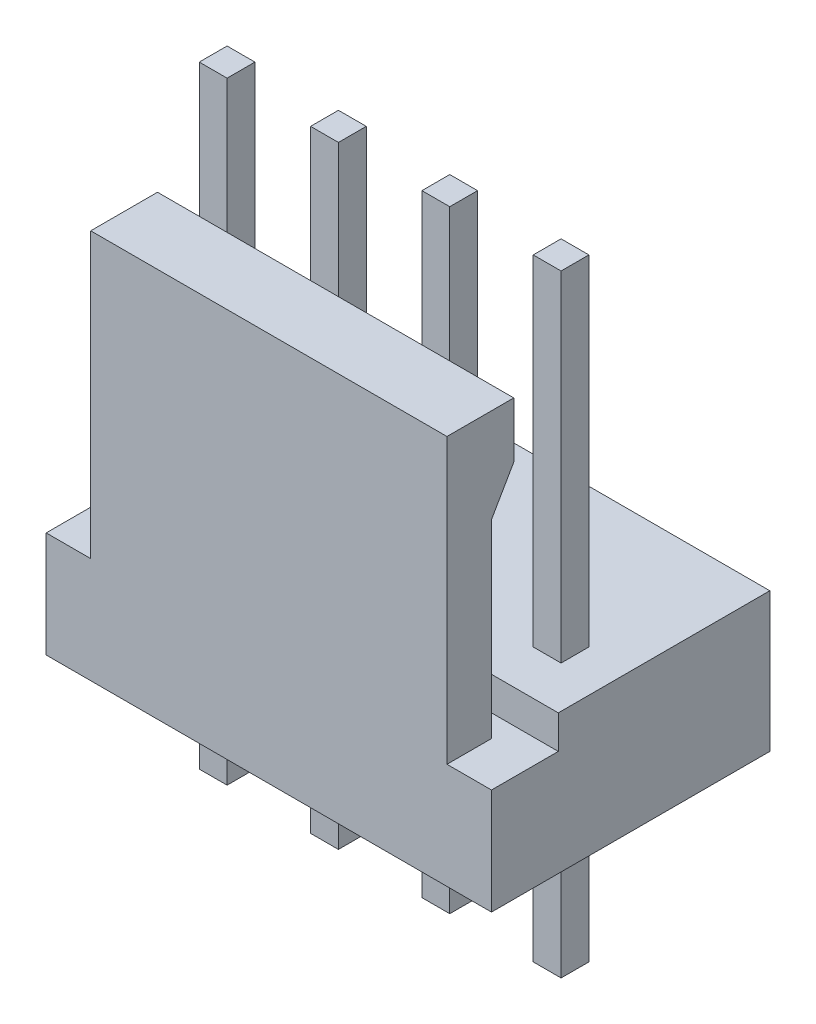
ISO-10303-21;
HEADER;
FILE_DESCRIPTION(('STEP AP214'),'2;1');
FILE_NAME('part.step','',(''),(''),'','','');
FILE_SCHEMA(('AUTOMOTIVE_DESIGN { 1 0 10303 214 1 1 1 1 }'));
ENDSEC;
DATA;
#1=APPLICATION_CONTEXT('core data for automotive mechanical design processes');
#2=APPLICATION_PROTOCOL_DEFINITION('international standard','automotive_design',2000,#1);
#3=PRODUCT_CONTEXT('',#1,'mechanical');
#4=PRODUCT('Part','Part','',(#3));
#5=PRODUCT_RELATED_PRODUCT_CATEGORY('part','',(#4));
#6=PRODUCT_DEFINITION_FORMATION('','',#4);
#7=PRODUCT_DEFINITION_CONTEXT('part definition',#1,'design');
#8=PRODUCT_DEFINITION('design','',#6,#7);
#9=PRODUCT_DEFINITION_SHAPE('','',#8);
#10=(LENGTH_UNIT() NAMED_UNIT(*) SI_UNIT(.MILLI.,.METRE.));
#11=(NAMED_UNIT(*) PLANE_ANGLE_UNIT() SI_UNIT($,.RADIAN.));
#12=(NAMED_UNIT(*) SI_UNIT($,.STERADIAN.) SOLID_ANGLE_UNIT());
#13=UNCERTAINTY_MEASURE_WITH_UNIT(LENGTH_MEASURE(1.E-05),#10,'distance_accuracy_value','');
#14=(GEOMETRIC_REPRESENTATION_CONTEXT(3) GLOBAL_UNCERTAINTY_ASSIGNED_CONTEXT((#13)) GLOBAL_UNIT_ASSIGNED_CONTEXT((#10,
#11,#12)) REPRESENTATION_CONTEXT('',''));
#15=CARTESIAN_POINT('',(0.,0.,0.));
#16=DIRECTION('',(0.,0.,1.));
#17=DIRECTION('',(1.,0.,0.));
#18=AXIS2_PLACEMENT_3D('',#15,#16,#17);
#19=CARTESIAN_POINT('',(7.33044,8.24499214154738,-51.8049575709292));
#20=DIRECTION('',(0.,-0.499999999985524,-0.866025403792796));
#21=DIRECTION('',(0.,0.866025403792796,-0.499999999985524));
#22=AXIS2_PLACEMENT_3D('',#19,#20,#21);
#23=PLANE('',#22);
#24=DIRECTION('',(0.,-0.866025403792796,0.499999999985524));
#25=VECTOR('',#24,1.);
#26=CARTESIAN_POINT('',(15.621,8.70405909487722,-52.07));
#27=LINE('',#26,#25);
#28=CARTESIAN_POINT('',(15.621,9.14400000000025,-52.3239999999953));
#29=VERTEX_POINT('',#28);
#30=CARTESIAN_POINT('',(15.621,8.26411818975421,-51.8160000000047));
#31=VERTEX_POINT('',#30);
#32=EDGE_CURVE('E670',#29,#31,#27,.T.);
#33=ORIENTED_EDGE('',*,*,#32,.T.);
#34=DIRECTION('',(1.,0.,0.));
#35=VECTOR('',#34,1.);
#36=CARTESIAN_POINT('',(11.557,8.26411818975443,-51.816));
#37=LINE('',#36,#35);
#38=CARTESIAN_POINT('',(7.493,8.26411818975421,-51.8160000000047));
#39=VERTEX_POINT('',#38);
#40=EDGE_CURVE('E651',#39,#31,#37,.T.);
#41=ORIENTED_EDGE('',*,*,#40,.F.);
#42=DIRECTION('',(0.,0.866025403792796,-0.499999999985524));
#43=VECTOR('',#42,1.);
#44=CARTESIAN_POINT('',(7.493,8.70405909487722,-52.07));
#45=LINE('',#44,#43);
#46=CARTESIAN_POINT('',(7.493,9.14400000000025,-52.3239999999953));
#47=VERTEX_POINT('',#46);
#48=EDGE_CURVE('E672',#39,#47,#45,.T.);
#49=ORIENTED_EDGE('',*,*,#48,.T.);
#50=DIRECTION('',(-1.,0.,0.));
#51=VECTOR('',#50,1.);
#52=CARTESIAN_POINT('',(11.557,9.144,-52.324));
#53=LINE('',#52,#51);
#54=EDGE_CURVE('E648',#29,#47,#53,.T.);
#55=ORIENTED_EDGE('',*,*,#54,.F.);
#56=EDGE_LOOP('',(#33,#41,#49,#55));
#57=FACE_BOUND('',#56,.T.);
#58=ADVANCED_FACE('F16',(#57),#23,.T.);
#59=CARTESIAN_POINT('',(15.0274151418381,12.7254,-53.975));
#60=DIRECTION('',(0.,0.,-1.));
#61=DIRECTION('',(1.,0.,0.));
#62=AXIS2_PLACEMENT_3D('',#59,#60,#61);
#63=PLANE('',#62);
#64=DIRECTION('',(1.,0.,0.));
#65=VECTOR('',#64,1.);
#66=CARTESIAN_POINT('',(15.367,-1.524,-53.9750000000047));
#67=LINE('',#66,#65);
#68=CARTESIAN_POINT('',(15.0494999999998,-1.524,-53.9750000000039));
#69=VERTEX_POINT('',#68);
#70=CARTESIAN_POINT('',(15.6845000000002,-1.524,-53.9750000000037));
#71=VERTEX_POINT('',#70);
#72=EDGE_CURVE('E639',#69,#71,#67,.T.);
#73=ORIENTED_EDGE('',*,*,#72,.F.);
#74=DIRECTION('',(0.,-1.,0.));
#75=VECTOR('',#74,1.);
#76=CARTESIAN_POINT('',(15.0495,5.461,-53.9750000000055));
#77=LINE('',#76,#75);
#78=CARTESIAN_POINT('',(15.0494999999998,1.524,-53.9750000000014));
#79=VERTEX_POINT('',#78);
#80=EDGE_CURVE('E644',#79,#69,#77,.T.);
#81=ORIENTED_EDGE('',*,*,#80,.F.);
#82=DIRECTION('',(1.,0.,0.));
#83=VECTOR('',#82,1.);
#84=CARTESIAN_POINT('',(15.367,1.524,-53.975));
#85=LINE('',#84,#83);
#86=CARTESIAN_POINT('',(15.6845000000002,1.524,-53.9750000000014));
#87=VERTEX_POINT('',#86);
#88=EDGE_CURVE('E668',#79,#87,#85,.T.);
#89=ORIENTED_EDGE('',*,*,#88,.T.);
#90=DIRECTION('',(0.,1.,0.));
#91=VECTOR('',#90,1.);
#92=CARTESIAN_POINT('',(15.6845,5.461,-53.9750000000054));
#93=LINE('',#92,#91);
#94=EDGE_CURVE('E631',#71,#87,#93,.T.);
#95=ORIENTED_EDGE('',*,*,#94,.F.);
#96=EDGE_LOOP('',(#73,#81,#89,#95));
#97=FACE_BOUND('',#96,.T.);
#98=ADVANCED_FACE('F977',(#97),#63,.T.);
#99=CARTESIAN_POINT('',(12.4874151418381,12.7254,-53.975));
#100=DIRECTION('',(0.,0.,-1.));
#101=DIRECTION('',(1.,0.,0.));
#102=AXIS2_PLACEMENT_3D('',#99,#100,#101);
#103=PLANE('',#102);
#104=DIRECTION('',(1.,0.,0.));
#105=VECTOR('',#104,1.);
#106=CARTESIAN_POINT('',(12.827,-1.524,-53.9750000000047));
#107=LINE('',#106,#105);
#108=CARTESIAN_POINT('',(12.5094999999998,-1.524,-53.9750000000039));
#109=VERTEX_POINT('',#108);
#110=CARTESIAN_POINT('',(13.1445000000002,-1.524,-53.9750000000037));
#111=VERTEX_POINT('',#110);
#112=EDGE_CURVE('E622',#109,#111,#107,.T.);
#113=ORIENTED_EDGE('',*,*,#112,.F.);
#114=DIRECTION('',(0.,-1.,0.));
#115=VECTOR('',#114,1.);
#116=CARTESIAN_POINT('',(12.5095,5.461,-53.9750000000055));
#117=LINE('',#116,#115);
#118=CARTESIAN_POINT('',(12.5094999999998,1.524,-53.9750000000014));
#119=VERTEX_POINT('',#118);
#120=EDGE_CURVE('E627',#119,#109,#117,.T.);
#121=ORIENTED_EDGE('',*,*,#120,.F.);
#122=DIRECTION('',(1.,0.,0.));
#123=VECTOR('',#122,1.);
#124=CARTESIAN_POINT('',(12.827,1.524,-53.975));
#125=LINE('',#124,#123);
#126=CARTESIAN_POINT('',(13.1445000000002,1.524,-53.9750000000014));
#127=VERTEX_POINT('',#126);
#128=EDGE_CURVE('E666',#119,#127,#125,.T.);
#129=ORIENTED_EDGE('',*,*,#128,.T.);
#130=DIRECTION('',(0.,1.,0.));
#131=VECTOR('',#130,1.);
#132=CARTESIAN_POINT('',(13.1445,5.461,-53.9750000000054));
#133=LINE('',#132,#131);
#134=EDGE_CURVE('E614',#111,#127,#133,.T.);
#135=ORIENTED_EDGE('',*,*,#134,.F.);
#136=EDGE_LOOP('',(#113,#121,#129,#135));
#137=FACE_BOUND('',#136,.T.);
#138=ADVANCED_FACE('F973',(#137),#103,.T.);
#139=CARTESIAN_POINT('',(9.94741514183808,12.7254,-53.975));
#140=DIRECTION('',(0.,0.,-1.));
#141=DIRECTION('',(1.,0.,0.));
#142=AXIS2_PLACEMENT_3D('',#139,#140,#141);
#143=PLANE('',#142);
#144=DIRECTION('',(1.,0.,0.));
#145=VECTOR('',#144,1.);
#146=CARTESIAN_POINT('',(10.287,-1.524,-53.9750000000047));
#147=LINE('',#146,#145);
#148=CARTESIAN_POINT('',(9.96949999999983,-1.524,-53.9750000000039));
#149=VERTEX_POINT('',#148);
#150=CARTESIAN_POINT('',(10.6045000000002,-1.524,-53.9750000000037));
#151=VERTEX_POINT('',#150);
#152=EDGE_CURVE('E605',#149,#151,#147,.T.);
#153=ORIENTED_EDGE('',*,*,#152,.F.);
#154=DIRECTION('',(0.,-1.,0.));
#155=VECTOR('',#154,1.);
#156=CARTESIAN_POINT('',(9.9695,5.461,-53.9750000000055));
#157=LINE('',#156,#155);
#158=CARTESIAN_POINT('',(9.96949999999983,1.524,-53.9750000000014));
#159=VERTEX_POINT('',#158);
#160=EDGE_CURVE('E610',#159,#149,#157,.T.);
#161=ORIENTED_EDGE('',*,*,#160,.F.);
#162=DIRECTION('',(1.,0.,0.));
#163=VECTOR('',#162,1.);
#164=CARTESIAN_POINT('',(10.287,1.524,-53.975));
#165=LINE('',#164,#163);
#166=CARTESIAN_POINT('',(10.6045000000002,1.524,-53.9750000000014));
#167=VERTEX_POINT('',#166);
#168=EDGE_CURVE('E664',#159,#167,#165,.T.);
#169=ORIENTED_EDGE('',*,*,#168,.T.);
#170=DIRECTION('',(0.,1.,0.));
#171=VECTOR('',#170,1.);
#172=CARTESIAN_POINT('',(10.6045,5.461,-53.9750000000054));
#173=LINE('',#172,#171);
#174=EDGE_CURVE('E597',#151,#167,#173,.T.);
#175=ORIENTED_EDGE('',*,*,#174,.F.);
#176=EDGE_LOOP('',(#153,#161,#169,#175));
#177=FACE_BOUND('',#176,.T.);
#178=ADVANCED_FACE('F969',(#177),#143,.T.);
#179=CARTESIAN_POINT('',(7.40741514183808,12.7254,-53.975));
#180=DIRECTION('',(0.,0.,-1.));
#181=DIRECTION('',(1.,0.,0.));
#182=AXIS2_PLACEMENT_3D('',#179,#180,#181);
#183=PLANE('',#182);
#184=DIRECTION('',(1.,0.,0.));
#185=VECTOR('',#184,1.);
#186=CARTESIAN_POINT('',(7.747,-1.524,-53.9750000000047));
#187=LINE('',#186,#185);
#188=CARTESIAN_POINT('',(7.42949999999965,-1.524,-53.9750000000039));
#189=VERTEX_POINT('',#188);
#190=CARTESIAN_POINT('',(8.06450000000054,-1.524,-53.9750000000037));
#191=VERTEX_POINT('',#190);
#192=EDGE_CURVE('E588',#189,#191,#187,.T.);
#193=ORIENTED_EDGE('',*,*,#192,.F.);
#194=DIRECTION('',(0.,-1.,0.));
#195=VECTOR('',#194,1.);
#196=CARTESIAN_POINT('',(7.4295,5.461,-53.9750000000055));
#197=LINE('',#196,#195);
#198=CARTESIAN_POINT('',(7.42949999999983,1.524,-53.9750000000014));
#199=VERTEX_POINT('',#198);
#200=EDGE_CURVE('E593',#199,#189,#197,.T.);
#201=ORIENTED_EDGE('',*,*,#200,.F.);
#202=DIRECTION('',(1.,0.,0.));
#203=VECTOR('',#202,1.);
#204=CARTESIAN_POINT('',(7.747,1.524,-53.975));
#205=LINE('',#204,#203);
#206=CARTESIAN_POINT('',(8.06450000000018,1.524,-53.9750000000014));
#207=VERTEX_POINT('',#206);
#208=EDGE_CURVE('E662',#199,#207,#205,.T.);
#209=ORIENTED_EDGE('',*,*,#208,.T.);
#210=DIRECTION('',(0.,1.,0.));
#211=VECTOR('',#210,1.);
#212=CARTESIAN_POINT('',(8.0645,5.461,-53.9750000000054));
#213=LINE('',#212,#211);
#214=EDGE_CURVE('E580',#191,#207,#213,.T.);
#215=ORIENTED_EDGE('',*,*,#214,.F.);
#216=EDGE_LOOP('',(#193,#201,#209,#215));
#217=FACE_BOUND('',#216,.T.);
#218=ADVANCED_FACE('F965',(#217),#183,.T.);
#219=CARTESIAN_POINT('',(15.7065848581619,12.7254,-53.34));
#220=DIRECTION('',(0.,0.,1.));
#221=DIRECTION('',(-1.,0.,0.));
#222=AXIS2_PLACEMENT_3D('',#219,#220,#221);
#223=PLANE('',#222);
#224=DIRECTION('',(-1.,0.,0.));
#225=VECTOR('',#224,1.);
#226=CARTESIAN_POINT('',(15.367,12.446,-53.3399999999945));
#227=LINE('',#226,#225);
#228=CARTESIAN_POINT('',(15.6845000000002,12.446,-53.3399999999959));
#229=VERTEX_POINT('',#228);
#230=CARTESIAN_POINT('',(15.0494999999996,12.446,-53.3399999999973));
#231=VERTEX_POINT('',#230);
#232=EDGE_CURVE('E563',#229,#231,#227,.T.);
#233=ORIENTED_EDGE('',*,*,#232,.T.);
#234=DIRECTION('',(0.,1.,0.));
#235=VECTOR('',#234,1.);
#236=CARTESIAN_POINT('',(15.0495,5.461,-53.3399999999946));
#237=LINE('',#236,#235);
#238=CARTESIAN_POINT('',(15.0494999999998,4.699,-53.3399999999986));
#239=VERTEX_POINT('',#238);
#240=EDGE_CURVE('E566',#239,#231,#237,.T.);
#241=ORIENTED_EDGE('',*,*,#240,.F.);
#242=DIRECTION('',(1.,0.,0.));
#243=VECTOR('',#242,1.);
#244=CARTESIAN_POINT('',(15.367,4.699,-53.34));
#245=LINE('',#244,#243);
#246=CARTESIAN_POINT('',(15.6845000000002,4.699,-53.3399999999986));
#247=VERTEX_POINT('',#246);
#248=EDGE_CURVE('E660',#239,#247,#245,.T.);
#249=ORIENTED_EDGE('',*,*,#248,.T.);
#250=DIRECTION('',(0.,-1.,0.));
#251=VECTOR('',#250,1.);
#252=CARTESIAN_POINT('',(15.6845,5.461,-53.3399999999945));
#253=LINE('',#252,#251);
#254=EDGE_CURVE('E552',#229,#247,#253,.T.);
#255=ORIENTED_EDGE('',*,*,#254,.F.);
#256=EDGE_LOOP('',(#233,#241,#249,#255));
#257=FACE_BOUND('',#256,.T.);
#258=ADVANCED_FACE('F961',(#257),#223,.T.);
#259=CARTESIAN_POINT('',(13.1665848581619,12.7254,-53.34));
#260=DIRECTION('',(0.,0.,1.));
#261=DIRECTION('',(-1.,0.,0.));
#262=AXIS2_PLACEMENT_3D('',#259,#260,#261);
#263=PLANE('',#262);
#264=DIRECTION('',(-1.,0.,0.));
#265=VECTOR('',#264,1.);
#266=CARTESIAN_POINT('',(12.827,12.446,-53.3399999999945));
#267=LINE('',#266,#265);
#268=CARTESIAN_POINT('',(13.1445000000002,12.446,-53.3399999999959));
#269=VERTEX_POINT('',#268);
#270=CARTESIAN_POINT('',(12.5094999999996,12.446,-53.3399999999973));
#271=VERTEX_POINT('',#270);
#272=EDGE_CURVE('E545',#269,#271,#267,.T.);
#273=ORIENTED_EDGE('',*,*,#272,.T.);
#274=DIRECTION('',(0.,1.,0.));
#275=VECTOR('',#274,1.);
#276=CARTESIAN_POINT('',(12.5095,5.461,-53.3399999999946));
#277=LINE('',#276,#275);
#278=CARTESIAN_POINT('',(12.5094999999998,4.699,-53.3399999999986));
#279=VERTEX_POINT('',#278);
#280=EDGE_CURVE('E548',#279,#271,#277,.T.);
#281=ORIENTED_EDGE('',*,*,#280,.F.);
#282=DIRECTION('',(1.,0.,0.));
#283=VECTOR('',#282,1.);
#284=CARTESIAN_POINT('',(12.827,4.699,-53.34));
#285=LINE('',#284,#283);
#286=CARTESIAN_POINT('',(13.1445000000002,4.699,-53.3399999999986));
#287=VERTEX_POINT('',#286);
#288=EDGE_CURVE('E658',#279,#287,#285,.T.);
#289=ORIENTED_EDGE('',*,*,#288,.T.);
#290=DIRECTION('',(0.,-1.,0.));
#291=VECTOR('',#290,1.);
#292=CARTESIAN_POINT('',(13.1445,5.461,-53.3399999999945));
#293=LINE('',#292,#291);
#294=EDGE_CURVE('E534',#269,#287,#293,.T.);
#295=ORIENTED_EDGE('',*,*,#294,.F.);
#296=EDGE_LOOP('',(#273,#281,#289,#295));
#297=FACE_BOUND('',#296,.T.);
#298=ADVANCED_FACE('F957',(#297),#263,.T.);
#299=CARTESIAN_POINT('',(10.6265848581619,12.7254,-53.34));
#300=DIRECTION('',(0.,0.,1.));
#301=DIRECTION('',(-1.,0.,0.));
#302=AXIS2_PLACEMENT_3D('',#299,#300,#301);
#303=PLANE('',#302);
#304=DIRECTION('',(-1.,0.,0.));
#305=VECTOR('',#304,1.);
#306=CARTESIAN_POINT('',(10.287,12.446,-53.3399999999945));
#307=LINE('',#306,#305);
#308=CARTESIAN_POINT('',(10.6045000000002,12.446,-53.3399999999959));
#309=VERTEX_POINT('',#308);
#310=CARTESIAN_POINT('',(9.96949999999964,12.446,-53.3399999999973));
#311=VERTEX_POINT('',#310);
#312=EDGE_CURVE('E527',#309,#311,#307,.T.);
#313=ORIENTED_EDGE('',*,*,#312,.T.);
#314=DIRECTION('',(0.,1.,0.));
#315=VECTOR('',#314,1.);
#316=CARTESIAN_POINT('',(9.9695,5.461,-53.3399999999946));
#317=LINE('',#316,#315);
#318=CARTESIAN_POINT('',(9.96949999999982,4.699,-53.3399999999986));
#319=VERTEX_POINT('',#318);
#320=EDGE_CURVE('E530',#319,#311,#317,.T.);
#321=ORIENTED_EDGE('',*,*,#320,.F.);
#322=DIRECTION('',(1.,0.,0.));
#323=VECTOR('',#322,1.);
#324=CARTESIAN_POINT('',(10.287,4.699,-53.34));
#325=LINE('',#324,#323);
#326=CARTESIAN_POINT('',(10.6045000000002,4.699,-53.3399999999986));
#327=VERTEX_POINT('',#326);
#328=EDGE_CURVE('E656',#319,#327,#325,.T.);
#329=ORIENTED_EDGE('',*,*,#328,.T.);
#330=DIRECTION('',(0.,-1.,0.));
#331=VECTOR('',#330,1.);
#332=CARTESIAN_POINT('',(10.6045,5.461,-53.3399999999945));
#333=LINE('',#332,#331);
#334=EDGE_CURVE('E516',#309,#327,#333,.T.);
#335=ORIENTED_EDGE('',*,*,#334,.F.);
#336=EDGE_LOOP('',(#313,#321,#329,#335));
#337=FACE_BOUND('',#336,.T.);
#338=ADVANCED_FACE('F953',(#337),#303,.T.);
#339=CARTESIAN_POINT('',(8.08658485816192,12.7254,-53.34));
#340=DIRECTION('',(0.,0.,1.));
#341=DIRECTION('',(-1.,0.,0.));
#342=AXIS2_PLACEMENT_3D('',#339,#340,#341);
#343=PLANE('',#342);
#344=DIRECTION('',(-1.,0.,0.));
#345=VECTOR('',#344,1.);
#346=CARTESIAN_POINT('',(7.747,12.446,-53.3399999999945));
#347=LINE('',#346,#345);
#348=CARTESIAN_POINT('',(8.06450000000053,12.446,-53.3399999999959));
#349=VERTEX_POINT('',#348);
#350=CARTESIAN_POINT('',(7.42949999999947,12.446,-53.3399999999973));
#351=VERTEX_POINT('',#350);
#352=EDGE_CURVE('E509',#349,#351,#347,.T.);
#353=ORIENTED_EDGE('',*,*,#352,.T.);
#354=DIRECTION('',(0.,1.,0.));
#355=VECTOR('',#354,1.);
#356=CARTESIAN_POINT('',(7.4295,5.461,-53.3399999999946));
#357=LINE('',#356,#355);
#358=CARTESIAN_POINT('',(7.42949999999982,4.699,-53.3399999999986));
#359=VERTEX_POINT('',#358);
#360=EDGE_CURVE('E512',#359,#351,#357,.T.);
#361=ORIENTED_EDGE('',*,*,#360,.F.);
#362=DIRECTION('',(1.,0.,0.));
#363=VECTOR('',#362,1.);
#364=CARTESIAN_POINT('',(7.747,4.699,-53.34));
#365=LINE('',#364,#363);
#366=CARTESIAN_POINT('',(8.06450000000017,4.699,-53.3399999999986));
#367=VERTEX_POINT('',#366);
#368=EDGE_CURVE('E654',#359,#367,#365,.T.);
#369=ORIENTED_EDGE('',*,*,#368,.T.);
#370=DIRECTION('',(0.,-1.,0.));
#371=VECTOR('',#370,1.);
#372=CARTESIAN_POINT('',(8.0645,5.461,-53.3399999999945));
#373=LINE('',#372,#371);
#374=EDGE_CURVE('E498',#349,#367,#373,.T.);
#375=ORIENTED_EDGE('',*,*,#374,.F.);
#376=EDGE_LOOP('',(#353,#361,#369,#375));
#377=FACE_BOUND('',#376,.T.);
#378=ADVANCED_FACE('F949',(#377),#343,.T.);
#379=CARTESIAN_POINT('',(7.33044,3.8504576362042,-51.816));
#380=DIRECTION('',(0.,0.,-1.));
#381=DIRECTION('',(0.,1.,0.));
#382=AXIS2_PLACEMENT_3D('',#379,#380,#381);
#383=PLANE('',#382);
#384=DIRECTION('',(0.,1.,0.));
#385=VECTOR('',#384,1.);
#386=CARTESIAN_POINT('',(15.621,7.1755,-51.816));
#387=LINE('',#386,#385);
#388=CARTESIAN_POINT('',(15.621,3.93699999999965,-51.816));
#389=VERTEX_POINT('',#388);
#390=EDGE_CURVE('E488',#389,#31,#387,.T.);
#391=ORIENTED_EDGE('',*,*,#390,.F.);
#392=DIRECTION('',(1.,0.,0.));
#393=VECTOR('',#392,1.);
#394=CARTESIAN_POINT('',(11.557,3.937,-51.816));
#395=LINE('',#394,#393);
#396=CARTESIAN_POINT('',(7.493,3.93699999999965,-51.816));
#397=VERTEX_POINT('',#396);
#398=EDGE_CURVE('E578',#397,#389,#395,.T.);
#399=ORIENTED_EDGE('',*,*,#398,.F.);
#400=DIRECTION('',(0.,-1.,0.));
#401=VECTOR('',#400,1.);
#402=CARTESIAN_POINT('',(7.493,7.1755,-51.816));
#403=LINE('',#402,#401);
#404=EDGE_CURVE('E363',#39,#397,#403,.T.);
#405=ORIENTED_EDGE('',*,*,#404,.F.);
#406=ORIENTED_EDGE('',*,*,#40,.T.);
#407=EDGE_LOOP('',(#391,#399,#405,#406));
#408=FACE_BOUND('',#407,.T.);
#409=ADVANCED_FACE('F945',(#408),#383,.T.);
#410=CARTESIAN_POINT('',(7.33044,9.1186,-52.324));
#411=DIRECTION('',(0.,0.,-1.));
#412=DIRECTION('',(0.,1.,0.));
#413=AXIS2_PLACEMENT_3D('',#410,#411,#412);
#414=PLANE('',#413);
#415=DIRECTION('',(0.,1.,0.));
#416=VECTOR('',#415,1.);
#417=CARTESIAN_POINT('',(15.621,7.1755,-52.324));
#418=LINE('',#417,#416);
#419=CARTESIAN_POINT('',(15.621,10.414,-52.324));
#420=VERTEX_POINT('',#419);
#421=EDGE_CURVE('E486',#29,#420,#418,.T.);
#422=ORIENTED_EDGE('',*,*,#421,.F.);
#423=ORIENTED_EDGE('',*,*,#54,.T.);
#424=DIRECTION('',(0.,-1.,0.));
#425=VECTOR('',#424,1.);
#426=CARTESIAN_POINT('',(7.493,7.1755,-52.324));
#427=LINE('',#426,#425);
#428=CARTESIAN_POINT('',(7.493,10.414,-52.324));
#429=VERTEX_POINT('',#428);
#430=EDGE_CURVE('E491',#429,#47,#427,.T.);
#431=ORIENTED_EDGE('',*,*,#430,.F.);
#432=DIRECTION('',(-1.,0.,0.));
#433=VECTOR('',#432,1.);
#434=CARTESIAN_POINT('',(11.557,10.414,-52.324));
#435=LINE('',#434,#433);
#436=EDGE_CURVE('E475',#420,#429,#435,.T.);
#437=ORIENTED_EDGE('',*,*,#436,.F.);
#438=EDGE_LOOP('',(#422,#423,#431,#437));
#439=FACE_BOUND('',#438,.T.);
#440=ADVANCED_FACE('F941',(#439),#414,.T.);
#441=CARTESIAN_POINT('',(15.0495,12.7254,-53.317915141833));
#442=DIRECTION('',(-1.,0.,0.));
#443=DIRECTION('',(0.,0.,-1.));
#444=AXIS2_PLACEMENT_3D('',#441,#442,#443);
#445=PLANE('',#444);
#446=DIRECTION('',(0.,0.,-1.));
#447=VECTOR('',#446,1.);
#448=CARTESIAN_POINT('',(15.0495,-1.524,-53.6575));
#449=LINE('',#448,#447);
#450=CARTESIAN_POINT('',(15.0494999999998,-1.524,-53.3399999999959));
#451=VERTEX_POINT('',#450);
#452=EDGE_CURVE('E641',#451,#69,#449,.T.);
#453=ORIENTED_EDGE('',*,*,#452,.F.);
#454=DIRECTION('',(0.,-1.,0.));
#455=VECTOR('',#454,1.);
#456=CARTESIAN_POINT('',(15.0494999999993,5.461,-53.34));
#457=LINE('',#456,#455);
#458=CARTESIAN_POINT('',(15.0494999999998,1.524,-53.3399999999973));
#459=VERTEX_POINT('',#458);
#460=EDGE_CURVE('E473',#459,#451,#457,.T.);
#461=ORIENTED_EDGE('',*,*,#460,.F.);
#462=DIRECTION('',(0.,0.,-1.));
#463=VECTOR('',#462,1.);
#464=CARTESIAN_POINT('',(15.0495,1.524,-53.6575));
#465=LINE('',#464,#463);
#466=EDGE_CURVE('E646',#459,#79,#465,.T.);
#467=ORIENTED_EDGE('',*,*,#466,.T.);
#468=ORIENTED_EDGE('',*,*,#80,.T.);
#469=EDGE_LOOP('',(#453,#461,#467,#468));
#470=FACE_BOUND('',#469,.T.);
#471=ADVANCED_FACE('F937',(#470),#445,.T.);
#472=CARTESIAN_POINT('',(15.7065848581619,-1.524,-53.317915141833));
#473=DIRECTION('',(0.,-1.,0.));
#474=DIRECTION('',(-1.,0.,0.));
#475=AXIS2_PLACEMENT_3D('',#472,#473,#474);
#476=PLANE('',#475);
#477=ORIENTED_EDGE('',*,*,#452,.T.);
#478=ORIENTED_EDGE('',*,*,#72,.T.);
#479=DIRECTION('',(0.,0.,-1.));
#480=VECTOR('',#479,1.);
#481=CARTESIAN_POINT('',(15.6845,-1.524,-53.6575));
#482=LINE('',#481,#480);
#483=CARTESIAN_POINT('',(15.6845000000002,-1.524,-53.3399999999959));
#484=VERTEX_POINT('',#483);
#485=EDGE_CURVE('E634',#484,#71,#482,.T.);
#486=ORIENTED_EDGE('',*,*,#485,.F.);
#487=DIRECTION('',(1.,0.,0.));
#488=VECTOR('',#487,1.);
#489=CARTESIAN_POINT('',(15.367,-1.524,-53.34));
#490=LINE('',#489,#488);
#491=EDGE_CURVE('E471',#451,#484,#490,.T.);
#492=ORIENTED_EDGE('',*,*,#491,.F.);
#493=EDGE_LOOP('',(#477,#478,#486,#492));
#494=FACE_BOUND('',#493,.T.);
#495=ADVANCED_FACE('F933',(#494),#476,.T.);
#496=CARTESIAN_POINT('',(15.6845,12.7254,-53.997084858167));
#497=DIRECTION('',(1.,0.,0.));
#498=DIRECTION('',(0.,0.,1.));
#499=AXIS2_PLACEMENT_3D('',#496,#497,#498);
#500=PLANE('',#499);
#501=ORIENTED_EDGE('',*,*,#485,.T.);
#502=ORIENTED_EDGE('',*,*,#94,.T.);
#503=DIRECTION('',(0.,0.,1.));
#504=VECTOR('',#503,1.);
#505=CARTESIAN_POINT('',(15.6845,1.524,-53.6575));
#506=LINE('',#505,#504);
#507=CARTESIAN_POINT('',(15.6845000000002,1.524,-53.3399999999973));
#508=VERTEX_POINT('',#507);
#509=EDGE_CURVE('E637',#87,#508,#506,.T.);
#510=ORIENTED_EDGE('',*,*,#509,.T.);
#511=DIRECTION('',(0.,1.,0.));
#512=VECTOR('',#511,1.);
#513=CARTESIAN_POINT('',(15.6845000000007,5.461,-53.34));
#514=LINE('',#513,#512);
#515=EDGE_CURVE('E468',#484,#508,#514,.T.);
#516=ORIENTED_EDGE('',*,*,#515,.F.);
#517=EDGE_LOOP('',(#501,#502,#510,#516));
#518=FACE_BOUND('',#517,.T.);
#519=ADVANCED_FACE('F929',(#518),#500,.T.);
#520=CARTESIAN_POINT('',(12.5095,12.7254,-53.317915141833));
#521=DIRECTION('',(-1.,0.,0.));
#522=DIRECTION('',(0.,0.,-1.));
#523=AXIS2_PLACEMENT_3D('',#520,#521,#522);
#524=PLANE('',#523);
#525=DIRECTION('',(0.,0.,-1.));
#526=VECTOR('',#525,1.);
#527=CARTESIAN_POINT('',(12.5095,-1.524,-53.6575));
#528=LINE('',#527,#526);
#529=CARTESIAN_POINT('',(12.5094999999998,-1.524,-53.3399999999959));
#530=VERTEX_POINT('',#529);
#531=EDGE_CURVE('E624',#530,#109,#528,.T.);
#532=ORIENTED_EDGE('',*,*,#531,.F.);
#533=DIRECTION('',(0.,-1.,0.));
#534=VECTOR('',#533,1.);
#535=CARTESIAN_POINT('',(12.5094999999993,5.461,-53.34));
#536=LINE('',#535,#534);
#537=CARTESIAN_POINT('',(12.5094999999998,1.524,-53.3399999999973));
#538=VERTEX_POINT('',#537);
#539=EDGE_CURVE('E466',#538,#530,#536,.T.);
#540=ORIENTED_EDGE('',*,*,#539,.F.);
#541=DIRECTION('',(0.,0.,-1.));
#542=VECTOR('',#541,1.);
#543=CARTESIAN_POINT('',(12.5095,1.524,-53.6575));
#544=LINE('',#543,#542);
#545=EDGE_CURVE('E629',#538,#119,#544,.T.);
#546=ORIENTED_EDGE('',*,*,#545,.T.);
#547=ORIENTED_EDGE('',*,*,#120,.T.);
#548=EDGE_LOOP('',(#532,#540,#546,#547));
#549=FACE_BOUND('',#548,.T.);
#550=ADVANCED_FACE('F925',(#549),#524,.T.);
#551=CARTESIAN_POINT('',(13.1665848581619,-1.524,-53.317915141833));
#552=DIRECTION('',(0.,-1.,0.));
#553=DIRECTION('',(-1.,0.,0.));
#554=AXIS2_PLACEMENT_3D('',#551,#552,#553);
#555=PLANE('',#554);
#556=ORIENTED_EDGE('',*,*,#531,.T.);
#557=ORIENTED_EDGE('',*,*,#112,.T.);
#558=DIRECTION('',(0.,0.,-1.));
#559=VECTOR('',#558,1.);
#560=CARTESIAN_POINT('',(13.1445,-1.524,-53.6575));
#561=LINE('',#560,#559);
#562=CARTESIAN_POINT('',(13.1445000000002,-1.524,-53.3399999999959));
#563=VERTEX_POINT('',#562);
#564=EDGE_CURVE('E617',#563,#111,#561,.T.);
#565=ORIENTED_EDGE('',*,*,#564,.F.);
#566=DIRECTION('',(1.,0.,0.));
#567=VECTOR('',#566,1.);
#568=CARTESIAN_POINT('',(12.827,-1.524,-53.34));
#569=LINE('',#568,#567);
#570=EDGE_CURVE('E464',#530,#563,#569,.T.);
#571=ORIENTED_EDGE('',*,*,#570,.F.);
#572=EDGE_LOOP('',(#556,#557,#565,#571));
#573=FACE_BOUND('',#572,.T.);
#574=ADVANCED_FACE('F921',(#573),#555,.T.);
#575=CARTESIAN_POINT('',(13.1445,12.7254,-53.997084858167));
#576=DIRECTION('',(1.,0.,0.));
#577=DIRECTION('',(0.,0.,1.));
#578=AXIS2_PLACEMENT_3D('',#575,#576,#577);
#579=PLANE('',#578);
#580=ORIENTED_EDGE('',*,*,#564,.T.);
#581=ORIENTED_EDGE('',*,*,#134,.T.);
#582=DIRECTION('',(0.,0.,1.));
#583=VECTOR('',#582,1.);
#584=CARTESIAN_POINT('',(13.1445,1.524,-53.6575));
#585=LINE('',#584,#583);
#586=CARTESIAN_POINT('',(13.1445000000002,1.524,-53.3399999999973));
#587=VERTEX_POINT('',#586);
#588=EDGE_CURVE('E620',#127,#587,#585,.T.);
#589=ORIENTED_EDGE('',*,*,#588,.T.);
#590=DIRECTION('',(0.,1.,0.));
#591=VECTOR('',#590,1.);
#592=CARTESIAN_POINT('',(13.1445000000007,5.461,-53.34));
#593=LINE('',#592,#591);
#594=EDGE_CURVE('E461',#563,#587,#593,.T.);
#595=ORIENTED_EDGE('',*,*,#594,.F.);
#596=EDGE_LOOP('',(#580,#581,#589,#595));
#597=FACE_BOUND('',#596,.T.);
#598=ADVANCED_FACE('F917',(#597),#579,.T.);
#599=CARTESIAN_POINT('',(9.9695,12.7254,-53.317915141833));
#600=DIRECTION('',(-1.,0.,0.));
#601=DIRECTION('',(0.,0.,-1.));
#602=AXIS2_PLACEMENT_3D('',#599,#600,#601);
#603=PLANE('',#602);
#604=DIRECTION('',(0.,0.,-1.));
#605=VECTOR('',#604,1.);
#606=CARTESIAN_POINT('',(9.9695,-1.524,-53.6575));
#607=LINE('',#606,#605);
#608=CARTESIAN_POINT('',(9.96949999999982,-1.524,-53.3399999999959));
#609=VERTEX_POINT('',#608);
#610=EDGE_CURVE('E607',#609,#149,#607,.T.);
#611=ORIENTED_EDGE('',*,*,#610,.F.);
#612=DIRECTION('',(0.,-1.,0.));
#613=VECTOR('',#612,1.);
#614=CARTESIAN_POINT('',(9.96949999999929,5.461,-53.34));
#615=LINE('',#614,#613);
#616=CARTESIAN_POINT('',(9.96949999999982,1.524,-53.3399999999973));
#617=VERTEX_POINT('',#616);
#618=EDGE_CURVE('E459',#617,#609,#615,.T.);
#619=ORIENTED_EDGE('',*,*,#618,.F.);
#620=DIRECTION('',(0.,0.,-1.));
#621=VECTOR('',#620,1.);
#622=CARTESIAN_POINT('',(9.9695,1.524,-53.6575));
#623=LINE('',#622,#621);
#624=EDGE_CURVE('E612',#617,#159,#623,.T.);
#625=ORIENTED_EDGE('',*,*,#624,.T.);
#626=ORIENTED_EDGE('',*,*,#160,.T.);
#627=EDGE_LOOP('',(#611,#619,#625,#626));
#628=FACE_BOUND('',#627,.T.);
#629=ADVANCED_FACE('F913',(#628),#603,.T.);
#630=CARTESIAN_POINT('',(10.6265848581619,-1.524,-53.317915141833));
#631=DIRECTION('',(0.,-1.,0.));
#632=DIRECTION('',(-1.,0.,0.));
#633=AXIS2_PLACEMENT_3D('',#630,#631,#632);
#634=PLANE('',#633);
#635=ORIENTED_EDGE('',*,*,#610,.T.);
#636=ORIENTED_EDGE('',*,*,#152,.T.);
#637=DIRECTION('',(0.,0.,-1.));
#638=VECTOR('',#637,1.);
#639=CARTESIAN_POINT('',(10.6045,-1.524,-53.6575));
#640=LINE('',#639,#638);
#641=CARTESIAN_POINT('',(10.6045000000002,-1.524,-53.3399999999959));
#642=VERTEX_POINT('',#641);
#643=EDGE_CURVE('E600',#642,#151,#640,.T.);
#644=ORIENTED_EDGE('',*,*,#643,.F.);
#645=DIRECTION('',(1.,0.,0.));
#646=VECTOR('',#645,1.);
#647=CARTESIAN_POINT('',(10.287,-1.524,-53.34));
#648=LINE('',#647,#646);
#649=EDGE_CURVE('E457',#609,#642,#648,.T.);
#650=ORIENTED_EDGE('',*,*,#649,.F.);
#651=EDGE_LOOP('',(#635,#636,#644,#650));
#652=FACE_BOUND('',#651,.T.);
#653=ADVANCED_FACE('F909',(#652),#634,.T.);
#654=CARTESIAN_POINT('',(10.6045,12.7254,-53.997084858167));
#655=DIRECTION('',(1.,0.,0.));
#656=DIRECTION('',(0.,0.,1.));
#657=AXIS2_PLACEMENT_3D('',#654,#655,#656);
#658=PLANE('',#657);
#659=ORIENTED_EDGE('',*,*,#643,.T.);
#660=ORIENTED_EDGE('',*,*,#174,.T.);
#661=DIRECTION('',(0.,0.,1.));
#662=VECTOR('',#661,1.);
#663=CARTESIAN_POINT('',(10.6045,1.524,-53.6575));
#664=LINE('',#663,#662);
#665=CARTESIAN_POINT('',(10.6045000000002,1.524,-53.3399999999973));
#666=VERTEX_POINT('',#665);
#667=EDGE_CURVE('E603',#167,#666,#664,.T.);
#668=ORIENTED_EDGE('',*,*,#667,.T.);
#669=DIRECTION('',(0.,1.,0.));
#670=VECTOR('',#669,1.);
#671=CARTESIAN_POINT('',(10.6045000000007,5.461,-53.34));
#672=LINE('',#671,#670);
#673=EDGE_CURVE('E454',#642,#666,#672,.T.);
#674=ORIENTED_EDGE('',*,*,#673,.F.);
#675=EDGE_LOOP('',(#659,#660,#668,#674));
#676=FACE_BOUND('',#675,.T.);
#677=ADVANCED_FACE('F905',(#676),#658,.T.);
#678=CARTESIAN_POINT('',(7.4295,12.7254,-53.317915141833));
#679=DIRECTION('',(-1.,0.,0.));
#680=DIRECTION('',(0.,0.,-1.));
#681=AXIS2_PLACEMENT_3D('',#678,#679,#680);
#682=PLANE('',#681);
#683=DIRECTION('',(0.,0.,-1.));
#684=VECTOR('',#683,1.);
#685=CARTESIAN_POINT('',(7.42949999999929,-1.524,-53.6575));
#686=LINE('',#685,#684);
#687=CARTESIAN_POINT('',(7.42949999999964,-1.524,-53.3399999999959));
#688=VERTEX_POINT('',#687);
#689=EDGE_CURVE('E590',#688,#189,#686,.T.);
#690=ORIENTED_EDGE('',*,*,#689,.F.);
#691=DIRECTION('',(0.,-1.,0.));
#692=VECTOR('',#691,1.);
#693=CARTESIAN_POINT('',(7.42949999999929,5.461,-53.34));
#694=LINE('',#693,#692);
#695=CARTESIAN_POINT('',(7.42949999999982,1.524,-53.3399999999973));
#696=VERTEX_POINT('',#695);
#697=EDGE_CURVE('E452',#696,#688,#694,.T.);
#698=ORIENTED_EDGE('',*,*,#697,.F.);
#699=DIRECTION('',(0.,0.,-1.));
#700=VECTOR('',#699,1.);
#701=CARTESIAN_POINT('',(7.4295,1.524,-53.6575));
#702=LINE('',#701,#700);
#703=EDGE_CURVE('E595',#696,#199,#702,.T.);
#704=ORIENTED_EDGE('',*,*,#703,.T.);
#705=ORIENTED_EDGE('',*,*,#200,.T.);
#706=EDGE_LOOP('',(#690,#698,#704,#705));
#707=FACE_BOUND('',#706,.T.);
#708=ADVANCED_FACE('F901',(#707),#682,.T.);
#709=CARTESIAN_POINT('',(8.08658485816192,-1.524,-53.317915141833));
#710=DIRECTION('',(0.,-1.,0.));
#711=DIRECTION('',(-1.,0.,0.));
#712=AXIS2_PLACEMENT_3D('',#709,#710,#711);
#713=PLANE('',#712);
#714=ORIENTED_EDGE('',*,*,#689,.T.);
#715=ORIENTED_EDGE('',*,*,#192,.T.);
#716=DIRECTION('',(0.,0.,-1.));
#717=VECTOR('',#716,1.);
#718=CARTESIAN_POINT('',(8.0645,-1.524,-53.6575));
#719=LINE('',#718,#717);
#720=CARTESIAN_POINT('',(8.06450000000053,-1.524,-53.3399999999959));
#721=VERTEX_POINT('',#720);
#722=EDGE_CURVE('E583',#721,#191,#719,.T.);
#723=ORIENTED_EDGE('',*,*,#722,.F.);
#724=DIRECTION('',(1.,0.,0.));
#725=VECTOR('',#724,1.);
#726=CARTESIAN_POINT('',(7.747,-1.524,-53.34));
#727=LINE('',#726,#725);
#728=EDGE_CURVE('E450',#688,#721,#727,.T.);
#729=ORIENTED_EDGE('',*,*,#728,.F.);
#730=EDGE_LOOP('',(#714,#715,#723,#729));
#731=FACE_BOUND('',#730,.T.);
#732=ADVANCED_FACE('F897',(#731),#713,.T.);
#733=CARTESIAN_POINT('',(8.0645,12.7254,-53.997084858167));
#734=DIRECTION('',(1.,0.,0.));
#735=DIRECTION('',(0.,0.,1.));
#736=AXIS2_PLACEMENT_3D('',#733,#734,#735);
#737=PLANE('',#736);
#738=ORIENTED_EDGE('',*,*,#722,.T.);
#739=ORIENTED_EDGE('',*,*,#214,.T.);
#740=DIRECTION('',(0.,0.,1.));
#741=VECTOR('',#740,1.);
#742=CARTESIAN_POINT('',(8.0645,1.524,-53.6575));
#743=LINE('',#742,#741);
#744=CARTESIAN_POINT('',(8.06450000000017,1.524,-53.3399999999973));
#745=VERTEX_POINT('',#744);
#746=EDGE_CURVE('E586',#207,#745,#743,.T.);
#747=ORIENTED_EDGE('',*,*,#746,.T.);
#748=DIRECTION('',(0.,1.,0.));
#749=VECTOR('',#748,1.);
#750=CARTESIAN_POINT('',(8.06450000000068,5.461,-53.34));
#751=LINE('',#750,#749);
#752=EDGE_CURVE('E447',#721,#745,#751,.T.);
#753=ORIENTED_EDGE('',*,*,#752,.F.);
#754=EDGE_LOOP('',(#738,#739,#747,#753));
#755=FACE_BOUND('',#754,.T.);
#756=ADVANCED_FACE('F894',(#755),#737,.T.);
#757=CARTESIAN_POINT('',(6.2738,3.937,-52.35448));
#758=DIRECTION('',(0.,1.,0.));
#759=DIRECTION('',(0.,0.,1.));
#760=AXIS2_PLACEMENT_3D('',#757,#758,#759);
#761=PLANE('',#760);
#762=DIRECTION('',(1.,0.,0.));
#763=VECTOR('',#762,1.);
#764=CARTESIAN_POINT('',(11.557,3.937,-50.8));
#765=LINE('',#764,#763);
#766=CARTESIAN_POINT('',(6.477,3.937,-50.8));
#767=VERTEX_POINT('',#766);
#768=CARTESIAN_POINT('',(7.493,3.937,-50.8));
#769=VERTEX_POINT('',#768);
#770=EDGE_CURVE('E570',#767,#769,#765,.T.);
#771=ORIENTED_EDGE('',*,*,#770,.T.);
#772=DIRECTION('',(0.,0.,1.));
#773=VECTOR('',#772,1.);
#774=CARTESIAN_POINT('',(7.493,3.937,-51.562));
#775=LINE('',#774,#773);
#776=EDGE_CURVE('E494',#397,#769,#775,.T.);
#777=ORIENTED_EDGE('',*,*,#776,.F.);
#778=ORIENTED_EDGE('',*,*,#398,.T.);
#779=DIRECTION('',(0.,0.,-1.));
#780=VECTOR('',#779,1.);
#781=CARTESIAN_POINT('',(15.621,3.937,-51.562));
#782=LINE('',#781,#780);
#783=CARTESIAN_POINT('',(15.621,3.937,-50.8));
#784=VERTEX_POINT('',#783);
#785=EDGE_CURVE('E483',#784,#389,#782,.T.);
#786=ORIENTED_EDGE('',*,*,#785,.F.);
#787=DIRECTION('',(1.,0.,0.));
#788=VECTOR('',#787,1.);
#789=CARTESIAN_POINT('',(11.557,3.937,-50.8));
#790=LINE('',#789,#788);
#791=CARTESIAN_POINT('',(16.637,3.937,-50.8));
#792=VERTEX_POINT('',#791);
#793=EDGE_CURVE('E576',#784,#792,#790,.T.);
#794=ORIENTED_EDGE('',*,*,#793,.T.);
#795=DIRECTION('',(0.,0.,-1.));
#796=VECTOR('',#795,1.);
#797=CARTESIAN_POINT('',(16.637,3.937,-51.562));
#798=LINE('',#797,#796);
#799=CARTESIAN_POINT('',(16.637,3.93699999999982,-52.324));
#800=VERTEX_POINT('',#799);
#801=EDGE_CURVE('E574',#792,#800,#798,.T.);
#802=ORIENTED_EDGE('',*,*,#801,.T.);
#803=DIRECTION('',(1.,0.,0.));
#804=VECTOR('',#803,1.);
#805=CARTESIAN_POINT('',(11.557,3.93699999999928,-52.324));
#806=LINE('',#805,#804);
#807=CARTESIAN_POINT('',(6.477,3.93699999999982,-52.324));
#808=VERTEX_POINT('',#807);
#809=EDGE_CURVE('E443',#808,#800,#806,.T.);
#810=ORIENTED_EDGE('',*,*,#809,.F.);
#811=DIRECTION('',(0.,0.,1.));
#812=VECTOR('',#811,1.);
#813=CARTESIAN_POINT('',(6.477,3.937,-51.562));
#814=LINE('',#813,#812);
#815=EDGE_CURVE('E572',#808,#767,#814,.T.);
#816=ORIENTED_EDGE('',*,*,#815,.T.);
#817=EDGE_LOOP('',(#771,#777,#778,#786,#794,#802,#810,#816));
#818=FACE_BOUND('',#817,.T.);
#819=ADVANCED_FACE('F754',(#818),#761,.T.);
#820=CARTESIAN_POINT('',(15.0495,12.7254,-53.317915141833));
#821=DIRECTION('',(-1.,0.,0.));
#822=DIRECTION('',(0.,0.,-1.));
#823=AXIS2_PLACEMENT_3D('',#820,#821,#822);
#824=PLANE('',#823);
#825=DIRECTION('',(0.,0.,-1.));
#826=VECTOR('',#825,1.);
#827=CARTESIAN_POINT('',(15.0495,12.446,-53.6575));
#828=LINE('',#827,#826);
#829=CARTESIAN_POINT('',(15.0494999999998,12.446,-53.9750000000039));
#830=VERTEX_POINT('',#829);
#831=EDGE_CURVE('E560',#231,#830,#828,.T.);
#832=ORIENTED_EDGE('',*,*,#831,.T.);
#833=DIRECTION('',(0.,1.,0.));
#834=VECTOR('',#833,1.);
#835=CARTESIAN_POINT('',(15.0494999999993,5.461,-53.975));
#836=LINE('',#835,#834);
#837=CARTESIAN_POINT('',(15.0494999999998,4.699,-53.9750000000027));
#838=VERTEX_POINT('',#837);
#839=EDGE_CURVE('E438',#838,#830,#836,.T.);
#840=ORIENTED_EDGE('',*,*,#839,.F.);
#841=DIRECTION('',(0.,0.,1.));
#842=VECTOR('',#841,1.);
#843=CARTESIAN_POINT('',(15.0495,4.699,-53.6575));
#844=LINE('',#843,#842);
#845=EDGE_CURVE('E568',#838,#239,#844,.T.);
#846=ORIENTED_EDGE('',*,*,#845,.T.);
#847=ORIENTED_EDGE('',*,*,#240,.T.);
#848=EDGE_LOOP('',(#832,#840,#846,#847));
#849=FACE_BOUND('',#848,.T.);
#850=ADVANCED_FACE('F887',(#849),#824,.T.);
#851=CARTESIAN_POINT('',(15.7065848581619,12.446,-53.317915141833));
#852=DIRECTION('',(0.,-1.,0.));
#853=DIRECTION('',(-1.,0.,0.));
#854=AXIS2_PLACEMENT_3D('',#851,#852,#853);
#855=PLANE('',#854);
#856=ORIENTED_EDGE('',*,*,#831,.F.);
#857=ORIENTED_EDGE('',*,*,#232,.F.);
#858=DIRECTION('',(0.,0.,1.));
#859=VECTOR('',#858,1.);
#860=CARTESIAN_POINT('',(15.6845,12.446,-53.6575));
#861=LINE('',#860,#859);
#862=CARTESIAN_POINT('',(15.6845000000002,12.446,-53.9750000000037));
#863=VERTEX_POINT('',#862);
#864=EDGE_CURVE('E555',#863,#229,#861,.T.);
#865=ORIENTED_EDGE('',*,*,#864,.F.);
#866=DIRECTION('',(1.,0.,0.));
#867=VECTOR('',#866,1.);
#868=CARTESIAN_POINT('',(15.367,12.446,-53.975));
#869=LINE('',#868,#867);
#870=EDGE_CURVE('E436',#830,#863,#869,.T.);
#871=ORIENTED_EDGE('',*,*,#870,.F.);
#872=EDGE_LOOP('',(#856,#857,#865,#871));
#873=FACE_BOUND('',#872,.T.);
#874=ADVANCED_FACE('F883',(#873),#855,.F.);
#875=CARTESIAN_POINT('',(15.6845,12.7254,-53.997084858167));
#876=DIRECTION('',(1.,0.,0.));
#877=DIRECTION('',(0.,0.,1.));
#878=AXIS2_PLACEMENT_3D('',#875,#876,#877);
#879=PLANE('',#878);
#880=ORIENTED_EDGE('',*,*,#864,.T.);
#881=ORIENTED_EDGE('',*,*,#254,.T.);
#882=DIRECTION('',(0.,0.,-1.));
#883=VECTOR('',#882,1.);
#884=CARTESIAN_POINT('',(15.6845,4.699,-53.6575));
#885=LINE('',#884,#883);
#886=CARTESIAN_POINT('',(15.6845000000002,4.699,-53.9750000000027));
#887=VERTEX_POINT('',#886);
#888=EDGE_CURVE('E558',#247,#887,#885,.T.);
#889=ORIENTED_EDGE('',*,*,#888,.T.);
#890=DIRECTION('',(0.,-1.,0.));
#891=VECTOR('',#890,1.);
#892=CARTESIAN_POINT('',(15.6845000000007,5.461,-53.975));
#893=LINE('',#892,#891);
#894=EDGE_CURVE('E433',#863,#887,#893,.T.);
#895=ORIENTED_EDGE('',*,*,#894,.F.);
#896=EDGE_LOOP('',(#880,#881,#889,#895));
#897=FACE_BOUND('',#896,.T.);
#898=ADVANCED_FACE('F879',(#897),#879,.T.);
#899=CARTESIAN_POINT('',(12.5095,12.7254,-53.317915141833));
#900=DIRECTION('',(-1.,0.,0.));
#901=DIRECTION('',(0.,0.,-1.));
#902=AXIS2_PLACEMENT_3D('',#899,#900,#901);
#903=PLANE('',#902);
#904=DIRECTION('',(0.,0.,-1.));
#905=VECTOR('',#904,1.);
#906=CARTESIAN_POINT('',(12.5095,12.446,-53.6575));
#907=LINE('',#906,#905);
#908=CARTESIAN_POINT('',(12.5094999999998,12.446,-53.9750000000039));
#909=VERTEX_POINT('',#908);
#910=EDGE_CURVE('E542',#271,#909,#907,.T.);
#911=ORIENTED_EDGE('',*,*,#910,.T.);
#912=DIRECTION('',(0.,1.,0.));
#913=VECTOR('',#912,1.);
#914=CARTESIAN_POINT('',(12.5094999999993,5.461,-53.975));
#915=LINE('',#914,#913);
#916=CARTESIAN_POINT('',(12.5094999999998,4.699,-53.9750000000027));
#917=VERTEX_POINT('',#916);
#918=EDGE_CURVE('E431',#917,#909,#915,.T.);
#919=ORIENTED_EDGE('',*,*,#918,.F.);
#920=DIRECTION('',(0.,0.,1.));
#921=VECTOR('',#920,1.);
#922=CARTESIAN_POINT('',(12.5095,4.699,-53.6575));
#923=LINE('',#922,#921);
#924=EDGE_CURVE('E550',#917,#279,#923,.T.);
#925=ORIENTED_EDGE('',*,*,#924,.T.);
#926=ORIENTED_EDGE('',*,*,#280,.T.);
#927=EDGE_LOOP('',(#911,#919,#925,#926));
#928=FACE_BOUND('',#927,.T.);
#929=ADVANCED_FACE('F875',(#928),#903,.T.);
#930=CARTESIAN_POINT('',(13.1665848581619,12.446,-53.317915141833));
#931=DIRECTION('',(0.,-1.,0.));
#932=DIRECTION('',(-1.,0.,0.));
#933=AXIS2_PLACEMENT_3D('',#930,#931,#932);
#934=PLANE('',#933);
#935=ORIENTED_EDGE('',*,*,#910,.F.);
#936=ORIENTED_EDGE('',*,*,#272,.F.);
#937=DIRECTION('',(0.,0.,1.));
#938=VECTOR('',#937,1.);
#939=CARTESIAN_POINT('',(13.1445,12.446,-53.6575));
#940=LINE('',#939,#938);
#941=CARTESIAN_POINT('',(13.1445000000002,12.446,-53.9750000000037));
#942=VERTEX_POINT('',#941);
#943=EDGE_CURVE('E537',#942,#269,#940,.T.);
#944=ORIENTED_EDGE('',*,*,#943,.F.);
#945=DIRECTION('',(1.,0.,0.));
#946=VECTOR('',#945,1.);
#947=CARTESIAN_POINT('',(12.827,12.446,-53.975));
#948=LINE('',#947,#946);
#949=EDGE_CURVE('E429',#909,#942,#948,.T.);
#950=ORIENTED_EDGE('',*,*,#949,.F.);
#951=EDGE_LOOP('',(#935,#936,#944,#950));
#952=FACE_BOUND('',#951,.T.);
#953=ADVANCED_FACE('F871',(#952),#934,.F.);
#954=CARTESIAN_POINT('',(13.1445,12.7254,-53.997084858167));
#955=DIRECTION('',(1.,0.,0.));
#956=DIRECTION('',(0.,0.,1.));
#957=AXIS2_PLACEMENT_3D('',#954,#955,#956);
#958=PLANE('',#957);
#959=ORIENTED_EDGE('',*,*,#943,.T.);
#960=ORIENTED_EDGE('',*,*,#294,.T.);
#961=DIRECTION('',(0.,0.,-1.));
#962=VECTOR('',#961,1.);
#963=CARTESIAN_POINT('',(13.1445,4.699,-53.6575));
#964=LINE('',#963,#962);
#965=CARTESIAN_POINT('',(13.1445000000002,4.699,-53.9750000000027));
#966=VERTEX_POINT('',#965);
#967=EDGE_CURVE('E540',#287,#966,#964,.T.);
#968=ORIENTED_EDGE('',*,*,#967,.T.);
#969=DIRECTION('',(0.,-1.,0.));
#970=VECTOR('',#969,1.);
#971=CARTESIAN_POINT('',(13.1445000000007,5.461,-53.975));
#972=LINE('',#971,#970);
#973=EDGE_CURVE('E426',#942,#966,#972,.T.);
#974=ORIENTED_EDGE('',*,*,#973,.F.);
#975=EDGE_LOOP('',(#959,#960,#968,#974));
#976=FACE_BOUND('',#975,.T.);
#977=ADVANCED_FACE('F867',(#976),#958,.T.);
#978=CARTESIAN_POINT('',(9.9695,12.7254,-53.317915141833));
#979=DIRECTION('',(-1.,0.,0.));
#980=DIRECTION('',(0.,0.,-1.));
#981=AXIS2_PLACEMENT_3D('',#978,#979,#980);
#982=PLANE('',#981);
#983=DIRECTION('',(0.,0.,-1.));
#984=VECTOR('',#983,1.);
#985=CARTESIAN_POINT('',(9.9695,12.446,-53.6575));
#986=LINE('',#985,#984);
#987=CARTESIAN_POINT('',(9.96949999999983,12.446,-53.9750000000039));
#988=VERTEX_POINT('',#987);
#989=EDGE_CURVE('E524',#311,#988,#986,.T.);
#990=ORIENTED_EDGE('',*,*,#989,.T.);
#991=DIRECTION('',(0.,1.,0.));
#992=VECTOR('',#991,1.);
#993=CARTESIAN_POINT('',(9.96949999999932,5.461,-53.975));
#994=LINE('',#993,#992);
#995=CARTESIAN_POINT('',(9.96949999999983,4.699,-53.9750000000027));
#996=VERTEX_POINT('',#995);
#997=EDGE_CURVE('E424',#996,#988,#994,.T.);
#998=ORIENTED_EDGE('',*,*,#997,.F.);
#999=DIRECTION('',(0.,0.,1.));
#1000=VECTOR('',#999,1.);
#1001=CARTESIAN_POINT('',(9.9695,4.699,-53.6575));
#1002=LINE('',#1001,#1000);
#1003=EDGE_CURVE('E532',#996,#319,#1002,.T.);
#1004=ORIENTED_EDGE('',*,*,#1003,.T.);
#1005=ORIENTED_EDGE('',*,*,#320,.T.);
#1006=EDGE_LOOP('',(#990,#998,#1004,#1005));
#1007=FACE_BOUND('',#1006,.T.);
#1008=ADVANCED_FACE('F863',(#1007),#982,.T.);
#1009=CARTESIAN_POINT('',(10.6265848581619,12.446,-53.317915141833));
#1010=DIRECTION('',(0.,-1.,0.));
#1011=DIRECTION('',(-1.,0.,0.));
#1012=AXIS2_PLACEMENT_3D('',#1009,#1010,#1011);
#1013=PLANE('',#1012);
#1014=ORIENTED_EDGE('',*,*,#989,.F.);
#1015=ORIENTED_EDGE('',*,*,#312,.F.);
#1016=DIRECTION('',(0.,0.,1.));
#1017=VECTOR('',#1016,1.);
#1018=CARTESIAN_POINT('',(10.6045,12.446,-53.6575));
#1019=LINE('',#1018,#1017);
#1020=CARTESIAN_POINT('',(10.6045000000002,12.446,-53.9750000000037));
#1021=VERTEX_POINT('',#1020);
#1022=EDGE_CURVE('E519',#1021,#309,#1019,.T.);
#1023=ORIENTED_EDGE('',*,*,#1022,.F.);
#1024=DIRECTION('',(1.,0.,0.));
#1025=VECTOR('',#1024,1.);
#1026=CARTESIAN_POINT('',(10.287,12.446,-53.975));
#1027=LINE('',#1026,#1025);
#1028=EDGE_CURVE('E422',#988,#1021,#1027,.T.);
#1029=ORIENTED_EDGE('',*,*,#1028,.F.);
#1030=EDGE_LOOP('',(#1014,#1015,#1023,#1029));
#1031=FACE_BOUND('',#1030,.T.);
#1032=ADVANCED_FACE('F859',(#1031),#1013,.F.);
#1033=CARTESIAN_POINT('',(10.6045,12.7254,-53.997084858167));
#1034=DIRECTION('',(1.,0.,0.));
#1035=DIRECTION('',(0.,0.,1.));
#1036=AXIS2_PLACEMENT_3D('',#1033,#1034,#1035);
#1037=PLANE('',#1036);
#1038=ORIENTED_EDGE('',*,*,#1022,.T.);
#1039=ORIENTED_EDGE('',*,*,#334,.T.);
#1040=DIRECTION('',(0.,0.,-1.));
#1041=VECTOR('',#1040,1.);
#1042=CARTESIAN_POINT('',(10.6045,4.699,-53.6575));
#1043=LINE('',#1042,#1041);
#1044=CARTESIAN_POINT('',(10.6045000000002,4.699,-53.9750000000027));
#1045=VERTEX_POINT('',#1044);
#1046=EDGE_CURVE('E522',#327,#1045,#1043,.T.);
#1047=ORIENTED_EDGE('',*,*,#1046,.T.);
#1048=DIRECTION('',(0.,-1.,0.));
#1049=VECTOR('',#1048,1.);
#1050=CARTESIAN_POINT('',(10.6045000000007,5.461,-53.975));
#1051=LINE('',#1050,#1049);
#1052=EDGE_CURVE('E419',#1021,#1045,#1051,.T.);
#1053=ORIENTED_EDGE('',*,*,#1052,.F.);
#1054=EDGE_LOOP('',(#1038,#1039,#1047,#1053));
#1055=FACE_BOUND('',#1054,.T.);
#1056=ADVANCED_FACE('F855',(#1055),#1037,.T.);
#1057=CARTESIAN_POINT('',(7.4295,12.7254,-53.317915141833));
#1058=DIRECTION('',(-1.,0.,0.));
#1059=DIRECTION('',(0.,0.,-1.));
#1060=AXIS2_PLACEMENT_3D('',#1057,#1058,#1059);
#1061=PLANE('',#1060);
#1062=DIRECTION('',(0.,0.,-1.));
#1063=VECTOR('',#1062,1.);
#1064=CARTESIAN_POINT('',(7.42949999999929,12.446,-53.6575));
#1065=LINE('',#1064,#1063);
#1066=CARTESIAN_POINT('',(7.42949999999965,12.446,-53.9750000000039));
#1067=VERTEX_POINT('',#1066);
#1068=EDGE_CURVE('E506',#351,#1067,#1065,.T.);
#1069=ORIENTED_EDGE('',*,*,#1068,.T.);
#1070=DIRECTION('',(0.,1.,0.));
#1071=VECTOR('',#1070,1.);
#1072=CARTESIAN_POINT('',(7.42949999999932,5.461,-53.975));
#1073=LINE('',#1072,#1071);
#1074=CARTESIAN_POINT('',(7.42949999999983,4.699,-53.9750000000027));
#1075=VERTEX_POINT('',#1074);
#1076=EDGE_CURVE('E417',#1075,#1067,#1073,.T.);
#1077=ORIENTED_EDGE('',*,*,#1076,.F.);
#1078=DIRECTION('',(0.,0.,1.));
#1079=VECTOR('',#1078,1.);
#1080=CARTESIAN_POINT('',(7.4295,4.699,-53.6575));
#1081=LINE('',#1080,#1079);
#1082=EDGE_CURVE('E514',#1075,#359,#1081,.T.);
#1083=ORIENTED_EDGE('',*,*,#1082,.T.);
#1084=ORIENTED_EDGE('',*,*,#360,.T.);
#1085=EDGE_LOOP('',(#1069,#1077,#1083,#1084));
#1086=FACE_BOUND('',#1085,.T.);
#1087=ADVANCED_FACE('F851',(#1086),#1061,.T.);
#1088=CARTESIAN_POINT('',(8.08658485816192,12.446,-53.317915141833));
#1089=DIRECTION('',(0.,-1.,0.));
#1090=DIRECTION('',(-1.,0.,0.));
#1091=AXIS2_PLACEMENT_3D('',#1088,#1089,#1090);
#1092=PLANE('',#1091);
#1093=ORIENTED_EDGE('',*,*,#1068,.F.);
#1094=ORIENTED_EDGE('',*,*,#352,.F.);
#1095=DIRECTION('',(0.,0.,1.));
#1096=VECTOR('',#1095,1.);
#1097=CARTESIAN_POINT('',(8.0645,12.446,-53.6575));
#1098=LINE('',#1097,#1096);
#1099=CARTESIAN_POINT('',(8.06450000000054,12.446,-53.9750000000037));
#1100=VERTEX_POINT('',#1099);
#1101=EDGE_CURVE('E501',#1100,#349,#1098,.T.);
#1102=ORIENTED_EDGE('',*,*,#1101,.F.);
#1103=DIRECTION('',(1.,0.,0.));
#1104=VECTOR('',#1103,1.);
#1105=CARTESIAN_POINT('',(7.747,12.446,-53.975));
#1106=LINE('',#1105,#1104);
#1107=EDGE_CURVE('E415',#1067,#1100,#1106,.T.);
#1108=ORIENTED_EDGE('',*,*,#1107,.F.);
#1109=EDGE_LOOP('',(#1093,#1094,#1102,#1108));
#1110=FACE_BOUND('',#1109,.T.);
#1111=ADVANCED_FACE('F847',(#1110),#1092,.F.);
#1112=CARTESIAN_POINT('',(8.0645,12.7254,-53.997084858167));
#1113=DIRECTION('',(1.,0.,0.));
#1114=DIRECTION('',(0.,0.,1.));
#1115=AXIS2_PLACEMENT_3D('',#1112,#1113,#1114);
#1116=PLANE('',#1115);
#1117=ORIENTED_EDGE('',*,*,#1101,.T.);
#1118=ORIENTED_EDGE('',*,*,#374,.T.);
#1119=DIRECTION('',(0.,0.,-1.));
#1120=VECTOR('',#1119,1.);
#1121=CARTESIAN_POINT('',(8.0645,4.699,-53.6575));
#1122=LINE('',#1121,#1120);
#1123=CARTESIAN_POINT('',(8.06450000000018,4.699,-53.9750000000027));
#1124=VERTEX_POINT('',#1123);
#1125=EDGE_CURVE('E504',#367,#1124,#1122,.T.);
#1126=ORIENTED_EDGE('',*,*,#1125,.T.);
#1127=DIRECTION('',(0.,-1.,0.));
#1128=VECTOR('',#1127,1.);
#1129=CARTESIAN_POINT('',(8.06450000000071,5.461,-53.975));
#1130=LINE('',#1129,#1128);
#1131=EDGE_CURVE('E412',#1100,#1124,#1130,.T.);
#1132=ORIENTED_EDGE('',*,*,#1131,.F.);
#1133=EDGE_LOOP('',(#1117,#1118,#1126,#1132));
#1134=FACE_BOUND('',#1133,.T.);
#1135=ADVANCED_FACE('F844',(#1134),#1116,.T.);
#1136=CARTESIAN_POINT('',(7.77563303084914,4.7244,-56.4140065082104));
#1137=DIRECTION('',(0.,1.,0.));
#1138=DIRECTION('',(-1.,0.,0.));
#1139=AXIS2_PLACEMENT_3D('',#1136,#1137,#1138);
#1140=PLANE('',#1139);
#1141=DIRECTION('',(0.,0.,1.));
#1142=VECTOR('',#1141,1.);
#1143=CARTESIAN_POINT('',(7.59100749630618,4.7244,-55.8485032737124));
#1144=LINE('',#1143,#1142);
#1145=CARTESIAN_POINT('',(7.59100749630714,4.7244,-56.3879999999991));
#1146=VERTEX_POINT('',#1145);
#1147=CARTESIAN_POINT('',(7.5910074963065,4.7244,-55.3090065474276));
#1148=VERTEX_POINT('',#1147);
#1149=EDGE_CURVE('E368',#1146,#1148,#1144,.T.);
#1150=ORIENTED_EDGE('',*,*,#1149,.F.);
#1151=DIRECTION('',(1.,0.,0.));
#1152=VECTOR('',#1151,1.);
#1153=CARTESIAN_POINT('',(7.50973715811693,4.7244,-56.388));
#1154=LINE('',#1153,#1152);
#1155=CARTESIAN_POINT('',(7.42846681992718,4.7244,-56.3879999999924));
#1156=VERTEX_POINT('',#1155);
#1157=EDGE_CURVE('E400',#1156,#1146,#1154,.T.);
#1158=ORIENTED_EDGE('',*,*,#1157,.F.);
#1159=DIRECTION('',(0.,0.,-1.));
#1160=VECTOR('',#1159,1.);
#1161=CARTESIAN_POINT('',(7.42846681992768,4.7244,-55.7378372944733));
#1162=LINE('',#1161,#1160);
#1163=CARTESIAN_POINT('',(7.42846681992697,4.7244,-55.0876745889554));
#1164=VERTEX_POINT('',#1163);
#1165=EDGE_CURVE('E410',#1164,#1156,#1162,.T.);
#1166=ORIENTED_EDGE('',*,*,#1165,.F.);
#1167=DIRECTION('',(1.,0.,0.));
#1168=VECTOR('',#1167,1.);
#1169=CARTESIAN_POINT('',(7.59100749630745,4.7244,-55.087674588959));
#1170=LINE('',#1169,#1168);
#1171=CARTESIAN_POINT('',(7.59100749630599,4.7244,-55.0876745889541));
#1172=VERTEX_POINT('',#1171);
#1173=EDGE_CURVE('E337',#1164,#1172,#1170,.T.);
#1174=ORIENTED_EDGE('',*,*,#1173,.T.);
#1175=DIRECTION('',(0.642871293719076,0.,-0.765974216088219));
#1176=VECTOR('',#1175,1.);
#1177=CARTESIAN_POINT('',(7.59100749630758,4.7244,-55.087674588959));
#1178=LINE('',#1177,#1176);
#1179=CARTESIAN_POINT('',(7.75354817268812,4.7244,-55.2813400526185));
#1180=VERTEX_POINT('',#1179);
#1181=EDGE_CURVE('E20',#1172,#1180,#1178,.T.);
#1182=ORIENTED_EDGE('',*,*,#1181,.T.);
#1183=DIRECTION('',(0.,0.,-1.));
#1184=VECTOR('',#1183,1.);
#1185=CARTESIAN_POINT('',(7.75354817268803,4.7244,-55.7378372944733));
#1186=LINE('',#1185,#1184);
#1187=CARTESIAN_POINT('',(7.75354817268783,4.7244,-55.5026720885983));
#1188=VERTEX_POINT('',#1187);
#1189=EDGE_CURVE('E344',#1180,#1188,#1186,.T.);
#1190=ORIENTED_EDGE('',*,*,#1189,.T.);
#1191=DIRECTION('',(-0.64287114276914,0.,0.765974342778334));
#1192=VECTOR('',#1191,1.);
#1193=CARTESIAN_POINT('',(7.75354817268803,4.7244,-55.502672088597));
#1194=LINE('',#1193,#1192);
#1195=EDGE_CURVE('E361',#1188,#1148,#1194,.T.);
#1196=ORIENTED_EDGE('',*,*,#1195,.T.);
#1197=EDGE_LOOP('',(#1150,#1158,#1166,#1174,#1182,#1190,#1196));
#1198=FACE_BOUND('',#1197,.T.);
#1199=ADVANCED_FACE('F342',(#1198),#1140,.T.);
#1200=CARTESIAN_POINT('',(7.493,3.80746,-52.35448));
#1201=DIRECTION('',(-1.,0.,0.));
#1202=DIRECTION('',(0.,0.,1.));
#1203=AXIS2_PLACEMENT_3D('',#1200,#1201,#1202);
#1204=PLANE('',#1203);
#1205=ORIENTED_EDGE('',*,*,#430,.T.);
#1206=ORIENTED_EDGE('',*,*,#48,.F.);
#1207=ORIENTED_EDGE('',*,*,#404,.T.);
#1208=ORIENTED_EDGE('',*,*,#776,.T.);
#1209=DIRECTION('',(0.,-1.,0.));
#1210=VECTOR('',#1209,1.);
#1211=CARTESIAN_POINT('',(7.493,5.969,-50.8));
#1212=LINE('',#1211,#1210);
#1213=CARTESIAN_POINT('',(7.493,10.414,-50.8));
#1214=VERTEX_POINT('',#1213);
#1215=EDGE_CURVE('E676',#1214,#769,#1212,.T.);
#1216=ORIENTED_EDGE('',*,*,#1215,.F.);
#1217=DIRECTION('',(0.,0.,1.));
#1218=VECTOR('',#1217,1.);
#1219=CARTESIAN_POINT('',(7.493,10.414,-51.562));
#1220=LINE('',#1219,#1218);
#1221=EDGE_CURVE('E481',#429,#1214,#1220,.T.);
#1222=ORIENTED_EDGE('',*,*,#1221,.F.);
#1223=EDGE_LOOP('',(#1205,#1206,#1207,#1208,#1216,#1222));
#1224=FACE_BOUND('',#1223,.T.);
#1225=ADVANCED_FACE('F837',(#1224),#1204,.T.);
#1226=CARTESIAN_POINT('',(15.621,3.80746,-50.76952));
#1227=DIRECTION('',(1.,0.,0.));
#1228=DIRECTION('',(0.,0.,-1.));
#1229=AXIS2_PLACEMENT_3D('',#1226,#1227,#1228);
#1230=PLANE('',#1229);
#1231=DIRECTION('',(0.,1.,0.));
#1232=VECTOR('',#1231,1.);
#1233=CARTESIAN_POINT('',(15.621,5.969,-50.8));
#1234=LINE('',#1233,#1232);
#1235=CARTESIAN_POINT('',(15.621,10.414,-50.8));
#1236=VERTEX_POINT('',#1235);
#1237=EDGE_CURVE('E685',#784,#1236,#1234,.T.);
#1238=ORIENTED_EDGE('',*,*,#1237,.F.);
#1239=ORIENTED_EDGE('',*,*,#785,.T.);
#1240=ORIENTED_EDGE('',*,*,#390,.T.);
#1241=ORIENTED_EDGE('',*,*,#32,.F.);
#1242=ORIENTED_EDGE('',*,*,#421,.T.);
#1243=DIRECTION('',(0.,0.,-1.));
#1244=VECTOR('',#1243,1.);
#1245=CARTESIAN_POINT('',(15.621,10.414,-51.562));
#1246=LINE('',#1245,#1244);
#1247=EDGE_CURVE('E478',#1236,#420,#1246,.T.);
#1248=ORIENTED_EDGE('',*,*,#1247,.F.);
#1249=EDGE_LOOP('',(#1238,#1239,#1240,#1241,#1242,#1248));
#1250=FACE_BOUND('',#1249,.T.);
#1251=ADVANCED_FACE('F833',(#1250),#1230,.T.);
#1252=CARTESIAN_POINT('',(7.33044,10.414,-52.35448));
#1253=DIRECTION('',(0.,1.,0.));
#1254=DIRECTION('',(0.,0.,1.));
#1255=AXIS2_PLACEMENT_3D('',#1252,#1253,#1254);
#1256=PLANE('',#1255);
#1257=ORIENTED_EDGE('',*,*,#1247,.T.);
#1258=ORIENTED_EDGE('',*,*,#436,.T.);
#1259=ORIENTED_EDGE('',*,*,#1221,.T.);
#1260=DIRECTION('',(-1.,0.,0.));
#1261=VECTOR('',#1260,1.);
#1262=CARTESIAN_POINT('',(11.557,10.414,-50.8));
#1263=LINE('',#1262,#1261);
#1264=EDGE_CURVE('E689',#1236,#1214,#1263,.T.);
#1265=ORIENTED_EDGE('',*,*,#1264,.F.);
#1266=EDGE_LOOP('',(#1257,#1258,#1259,#1265));
#1267=FACE_BOUND('',#1266,.T.);
#1268=ADVANCED_FACE('F829',(#1267),#1256,.T.);
#1269=CARTESIAN_POINT('',(15.7065848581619,12.7254,-53.34));
#1270=DIRECTION('',(0.,0.,1.));
#1271=DIRECTION('',(-1.,0.,0.));
#1272=AXIS2_PLACEMENT_3D('',#1269,#1270,#1271);
#1273=PLANE('',#1272);
#1274=ORIENTED_EDGE('',*,*,#491,.T.);
#1275=ORIENTED_EDGE('',*,*,#515,.T.);
#1276=DIRECTION('',(1.,0.,0.));
#1277=VECTOR('',#1276,1.);
#1278=CARTESIAN_POINT('',(11.557,1.524,-53.34));
#1279=LINE('',#1278,#1277);
#1280=EDGE_CURVE('E695',#459,#508,#1279,.T.);
#1281=ORIENTED_EDGE('',*,*,#1280,.F.);
#1282=ORIENTED_EDGE('',*,*,#460,.T.);
#1283=EDGE_LOOP('',(#1274,#1275,#1281,#1282));
#1284=FACE_BOUND('',#1283,.T.);
#1285=ADVANCED_FACE('F825',(#1284),#1273,.T.);
#1286=CARTESIAN_POINT('',(13.1665848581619,12.7254,-53.34));
#1287=DIRECTION('',(0.,0.,1.));
#1288=DIRECTION('',(-1.,0.,0.));
#1289=AXIS2_PLACEMENT_3D('',#1286,#1287,#1288);
#1290=PLANE('',#1289);
#1291=ORIENTED_EDGE('',*,*,#570,.T.);
#1292=ORIENTED_EDGE('',*,*,#594,.T.);
#1293=DIRECTION('',(1.,0.,0.));
#1294=VECTOR('',#1293,1.);
#1295=CARTESIAN_POINT('',(11.557,1.524,-53.34));
#1296=LINE('',#1295,#1294);
#1297=EDGE_CURVE('E698',#538,#587,#1296,.T.);
#1298=ORIENTED_EDGE('',*,*,#1297,.F.);
#1299=ORIENTED_EDGE('',*,*,#539,.T.);
#1300=EDGE_LOOP('',(#1291,#1292,#1298,#1299));
#1301=FACE_BOUND('',#1300,.T.);
#1302=ADVANCED_FACE('F821',(#1301),#1290,.T.);
#1303=CARTESIAN_POINT('',(10.6265848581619,12.7254,-53.34));
#1304=DIRECTION('',(0.,0.,1.));
#1305=DIRECTION('',(-1.,0.,0.));
#1306=AXIS2_PLACEMENT_3D('',#1303,#1304,#1305);
#1307=PLANE('',#1306);
#1308=ORIENTED_EDGE('',*,*,#649,.T.);
#1309=ORIENTED_EDGE('',*,*,#673,.T.);
#1310=DIRECTION('',(1.,0.,0.));
#1311=VECTOR('',#1310,1.);
#1312=CARTESIAN_POINT('',(11.557,1.524,-53.34));
#1313=LINE('',#1312,#1311);
#1314=EDGE_CURVE('E701',#617,#666,#1313,.T.);
#1315=ORIENTED_EDGE('',*,*,#1314,.F.);
#1316=ORIENTED_EDGE('',*,*,#618,.T.);
#1317=EDGE_LOOP('',(#1308,#1309,#1315,#1316));
#1318=FACE_BOUND('',#1317,.T.);
#1319=ADVANCED_FACE('F817',(#1318),#1307,.T.);
#1320=CARTESIAN_POINT('',(8.08658485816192,12.7254,-53.34));
#1321=DIRECTION('',(0.,0.,1.));
#1322=DIRECTION('',(-1.,0.,0.));
#1323=AXIS2_PLACEMENT_3D('',#1320,#1321,#1322);
#1324=PLANE('',#1323);
#1325=ORIENTED_EDGE('',*,*,#728,.T.);
#1326=ORIENTED_EDGE('',*,*,#752,.T.);
#1327=DIRECTION('',(1.,0.,0.));
#1328=VECTOR('',#1327,1.);
#1329=CARTESIAN_POINT('',(11.557,1.524,-53.34));
#1330=LINE('',#1329,#1328);
#1331=EDGE_CURVE('E704',#696,#745,#1330,.T.);
#1332=ORIENTED_EDGE('',*,*,#1331,.F.);
#1333=ORIENTED_EDGE('',*,*,#697,.T.);
#1334=EDGE_LOOP('',(#1325,#1326,#1332,#1333));
#1335=FACE_BOUND('',#1334,.T.);
#1336=ADVANCED_FACE('F814',(#1335),#1324,.T.);
#1337=CARTESIAN_POINT('',(6.2738,4.72108485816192,-52.324));
#1338=DIRECTION('',(0.,0.,1.));
#1339=DIRECTION('',(0.,-1.,0.));
#1340=AXIS2_PLACEMENT_3D('',#1337,#1338,#1339);
#1341=PLANE('',#1340);
#1342=DIRECTION('',(0.,-1.,0.));
#1343=VECTOR('',#1342,1.);
#1344=CARTESIAN_POINT('',(16.637,3.1115,-52.324));
#1345=LINE('',#1344,#1343);
#1346=CARTESIAN_POINT('',(16.637,4.69900000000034,-52.324));
#1347=VERTEX_POINT('',#1346);
#1348=EDGE_CURVE('E440',#1347,#800,#1345,.T.);
#1349=ORIENTED_EDGE('',*,*,#1348,.F.);
#1350=DIRECTION('',(1.,0.,0.));
#1351=VECTOR('',#1350,1.);
#1352=CARTESIAN_POINT('',(11.557,4.699,-52.324));
#1353=LINE('',#1352,#1351);
#1354=CARTESIAN_POINT('',(6.477,4.69900000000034,-52.324));
#1355=VERTEX_POINT('',#1354);
#1356=EDGE_CURVE('E711',#1355,#1347,#1353,.T.);
#1357=ORIENTED_EDGE('',*,*,#1356,.F.);
#1358=DIRECTION('',(0.,-1.,0.));
#1359=VECTOR('',#1358,1.);
#1360=CARTESIAN_POINT('',(6.477,4.318,-52.324));
#1361=LINE('',#1360,#1359);
#1362=EDGE_CURVE('E35',#1355,#808,#1361,.T.);
#1363=ORIENTED_EDGE('',*,*,#1362,.T.);
#1364=ORIENTED_EDGE('',*,*,#809,.T.);
#1365=EDGE_LOOP('',(#1349,#1357,#1363,#1364));
#1366=FACE_BOUND('',#1365,.T.);
#1367=ADVANCED_FACE('F757',(#1366),#1341,.T.);
#1368=CARTESIAN_POINT('',(16.637,1.4605,-50.673));
#1369=DIRECTION('',(1.,0.,0.));
#1370=DIRECTION('',(0.,0.,-1.));
#1371=AXIS2_PLACEMENT_3D('',#1368,#1369,#1370);
#1372=PLANE('',#1371);
#1373=DIRECTION('',(0.,0.,-1.));
#1374=VECTOR('',#1373,1.);
#1375=CARTESIAN_POINT('',(16.637,4.699,-54.737));
#1376=LINE('',#1375,#1374);
#1377=CARTESIAN_POINT('',(16.637,4.699,-57.15));
#1378=VERTEX_POINT('',#1377);
#1379=EDGE_CURVE('E713',#1347,#1378,#1376,.T.);
#1380=ORIENTED_EDGE('',*,*,#1379,.F.);
#1381=ORIENTED_EDGE('',*,*,#1348,.T.);
#1382=ORIENTED_EDGE('',*,*,#801,.F.);
#1383=DIRECTION('',(0.,1.,0.));
#1384=VECTOR('',#1383,1.);
#1385=CARTESIAN_POINT('',(16.637,5.969,-50.8));
#1386=LINE('',#1385,#1384);
#1387=CARTESIAN_POINT('',(16.637,1.524,-50.8));
#1388=VERTEX_POINT('',#1387);
#1389=EDGE_CURVE('E679',#1388,#792,#1386,.T.);
#1390=ORIENTED_EDGE('',*,*,#1389,.F.);
#1391=DIRECTION('',(0.,0.,1.));
#1392=VECTOR('',#1391,1.);
#1393=CARTESIAN_POINT('',(16.637,1.524,-53.975));
#1394=LINE('',#1393,#1392);
#1395=CARTESIAN_POINT('',(16.637,1.524,-57.15));
#1396=VERTEX_POINT('',#1395);
#1397=EDGE_CURVE('E691',#1396,#1388,#1394,.T.);
#1398=ORIENTED_EDGE('',*,*,#1397,.F.);
#1399=DIRECTION('',(0.,-1.,0.));
#1400=VECTOR('',#1399,1.);
#1401=CARTESIAN_POINT('',(16.637,3.1115,-57.15));
#1402=LINE('',#1401,#1400);
#1403=EDGE_CURVE('E707',#1378,#1396,#1402,.T.);
#1404=ORIENTED_EDGE('',*,*,#1403,.F.);
#1405=EDGE_LOOP('',(#1380,#1381,#1382,#1390,#1398,#1404));
#1406=FACE_BOUND('',#1405,.T.);
#1407=ADVANCED_FACE('F760',(#1406),#1372,.T.);
#1408=CARTESIAN_POINT('',(15.0274151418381,12.7254,-53.975));
#1409=DIRECTION('',(0.,0.,-1.));
#1410=DIRECTION('',(1.,0.,0.));
#1411=AXIS2_PLACEMENT_3D('',#1408,#1409,#1410);
#1412=PLANE('',#1411);
#1413=ORIENTED_EDGE('',*,*,#870,.T.);
#1414=ORIENTED_EDGE('',*,*,#894,.T.);
#1415=DIRECTION('',(1.,0.,0.));
#1416=VECTOR('',#1415,1.);
#1417=CARTESIAN_POINT('',(11.557,4.699,-53.975));
#1418=LINE('',#1417,#1416);
#1419=EDGE_CURVE('E717',#838,#887,#1418,.T.);
#1420=ORIENTED_EDGE('',*,*,#1419,.F.);
#1421=ORIENTED_EDGE('',*,*,#839,.T.);
#1422=EDGE_LOOP('',(#1413,#1414,#1420,#1421));
#1423=FACE_BOUND('',#1422,.T.);
#1424=ADVANCED_FACE('F805',(#1423),#1412,.T.);
#1425=CARTESIAN_POINT('',(12.4874151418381,12.7254,-53.975));
#1426=DIRECTION('',(0.,0.,-1.));
#1427=DIRECTION('',(1.,0.,0.));
#1428=AXIS2_PLACEMENT_3D('',#1425,#1426,#1427);
#1429=PLANE('',#1428);
#1430=ORIENTED_EDGE('',*,*,#949,.T.);
#1431=ORIENTED_EDGE('',*,*,#973,.T.);
#1432=DIRECTION('',(1.,0.,0.));
#1433=VECTOR('',#1432,1.);
#1434=CARTESIAN_POINT('',(11.557,4.699,-53.975));
#1435=LINE('',#1434,#1433);
#1436=EDGE_CURVE('E720',#917,#966,#1435,.T.);
#1437=ORIENTED_EDGE('',*,*,#1436,.F.);
#1438=ORIENTED_EDGE('',*,*,#918,.T.);
#1439=EDGE_LOOP('',(#1430,#1431,#1437,#1438));
#1440=FACE_BOUND('',#1439,.T.);
#1441=ADVANCED_FACE('F801',(#1440),#1429,.T.);
#1442=CARTESIAN_POINT('',(9.94741514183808,12.7254,-53.975));
#1443=DIRECTION('',(0.,0.,-1.));
#1444=DIRECTION('',(1.,0.,0.));
#1445=AXIS2_PLACEMENT_3D('',#1442,#1443,#1444);
#1446=PLANE('',#1445);
#1447=ORIENTED_EDGE('',*,*,#1028,.T.);
#1448=ORIENTED_EDGE('',*,*,#1052,.T.);
#1449=DIRECTION('',(1.,0.,0.));
#1450=VECTOR('',#1449,1.);
#1451=CARTESIAN_POINT('',(11.557,4.699,-53.975));
#1452=LINE('',#1451,#1450);
#1453=EDGE_CURVE('E723',#996,#1045,#1452,.T.);
#1454=ORIENTED_EDGE('',*,*,#1453,.F.);
#1455=ORIENTED_EDGE('',*,*,#997,.T.);
#1456=EDGE_LOOP('',(#1447,#1448,#1454,#1455));
#1457=FACE_BOUND('',#1456,.T.);
#1458=ADVANCED_FACE('F797',(#1457),#1446,.T.);
#1459=CARTESIAN_POINT('',(7.40741514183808,12.7254,-53.975));
#1460=DIRECTION('',(0.,0.,-1.));
#1461=DIRECTION('',(1.,0.,0.));
#1462=AXIS2_PLACEMENT_3D('',#1459,#1460,#1461);
#1463=PLANE('',#1462);
#1464=ORIENTED_EDGE('',*,*,#1107,.T.);
#1465=ORIENTED_EDGE('',*,*,#1131,.T.);
#1466=DIRECTION('',(1.,0.,0.));
#1467=VECTOR('',#1466,1.);
#1468=CARTESIAN_POINT('',(11.557,4.699,-53.975));
#1469=LINE('',#1468,#1467);
#1470=EDGE_CURVE('E726',#1075,#1124,#1469,.T.);
#1471=ORIENTED_EDGE('',*,*,#1470,.F.);
#1472=ORIENTED_EDGE('',*,*,#1076,.T.);
#1473=EDGE_LOOP('',(#1464,#1465,#1471,#1472));
#1474=FACE_BOUND('',#1473,.T.);
#1475=ADVANCED_FACE('F793',(#1474),#1463,.T.);
#1476=CARTESIAN_POINT('',(7.42846681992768,4.698492,-56.4140065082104));
#1477=DIRECTION('',(-1.,0.,0.));
#1478=DIRECTION('',(0.,0.,1.));
#1479=AXIS2_PLACEMENT_3D('',#1476,#1477,#1478);
#1480=PLANE('',#1479);
#1481=ORIENTED_EDGE('',*,*,#1165,.T.);
#1482=DIRECTION('',(0.,1.,0.));
#1483=VECTOR('',#1482,1.);
#1484=CARTESIAN_POINT('',(7.42846681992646,4.7117,-56.388));
#1485=LINE('',#1484,#1483);
#1486=CARTESIAN_POINT('',(7.42846681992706,4.699,-56.3879999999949));
#1487=VERTEX_POINT('',#1486);
#1488=EDGE_CURVE('E402',#1487,#1156,#1485,.T.);
#1489=ORIENTED_EDGE('',*,*,#1488,.F.);
#1490=DIRECTION('',(0.,0.,-1.));
#1491=VECTOR('',#1490,1.);
#1492=CARTESIAN_POINT('',(7.42846681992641,4.699,-54.737));
#1493=LINE('',#1492,#1491);
#1494=CARTESIAN_POINT('',(7.42846681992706,4.699,-55.0876745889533));
#1495=VERTEX_POINT('',#1494);
#1496=EDGE_CURVE('E729',#1495,#1487,#1493,.T.);
#1497=ORIENTED_EDGE('',*,*,#1496,.F.);
#1498=DIRECTION('',(0.,-1.,0.));
#1499=VECTOR('',#1498,1.);
#1500=CARTESIAN_POINT('',(7.42846681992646,4.7117,-55.0876745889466));
#1501=LINE('',#1500,#1499);
#1502=EDGE_CURVE('E405',#1164,#1495,#1501,.T.);
#1503=ORIENTED_EDGE('',*,*,#1502,.F.);
#1504=EDGE_LOOP('',(#1481,#1489,#1497,#1503));
#1505=FACE_BOUND('',#1504,.T.);
#1506=ADVANCED_FACE('F790',(#1505),#1480,.T.);
#1507=CARTESIAN_POINT('',(7.59425830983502,4.698492,-56.388));
#1508=DIRECTION('',(0.,0.,-1.));
#1509=DIRECTION('',(-1.,0.,0.));
#1510=AXIS2_PLACEMENT_3D('',#1507,#1508,#1509);
#1511=PLANE('',#1510);
#1512=ORIENTED_EDGE('',*,*,#1157,.T.);
#1513=DIRECTION('',(0.,1.,0.));
#1514=VECTOR('',#1513,1.);
#1515=CARTESIAN_POINT('',(7.59100749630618,4.7117,-56.3880000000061));
#1516=LINE('',#1515,#1514);
#1517=CARTESIAN_POINT('',(7.59100749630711,4.699,-56.3880000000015));
#1518=VERTEX_POINT('',#1517);
#1519=EDGE_CURVE('E371',#1518,#1146,#1516,.T.);
#1520=ORIENTED_EDGE('',*,*,#1519,.F.);
#1521=DIRECTION('',(1.,0.,0.));
#1522=VECTOR('',#1521,1.);
#1523=CARTESIAN_POINT('',(11.557,4.699,-56.388));
#1524=LINE('',#1523,#1522);
#1525=EDGE_CURVE('E383',#1487,#1518,#1524,.T.);
#1526=ORIENTED_EDGE('',*,*,#1525,.F.);
#1527=ORIENTED_EDGE('',*,*,#1488,.T.);
#1528=EDGE_LOOP('',(#1512,#1520,#1526,#1527));
#1529=FACE_BOUND('',#1528,.T.);
#1530=ADVANCED_FACE('F787',(#1529),#1511,.T.);
#1531=CARTESIAN_POINT('',(7.59100749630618,4.698492,-55.2874266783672));
#1532=DIRECTION('',(1.,0.,0.));
#1533=DIRECTION('',(0.,0.,-1.));
#1534=AXIS2_PLACEMENT_3D('',#1531,#1532,#1533);
#1535=PLANE('',#1534);
#1536=ORIENTED_EDGE('',*,*,#1149,.T.);
#1537=DIRECTION('',(0.,1.,0.));
#1538=VECTOR('',#1537,1.);
#1539=CARTESIAN_POINT('',(7.59100749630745,4.7117,-55.3090065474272));
#1540=LINE('',#1539,#1538);
#1541=CARTESIAN_POINT('',(7.59100749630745,4.699,-55.3090065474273));
#1542=VERTEX_POINT('',#1541);
#1543=EDGE_CURVE('E367',#1542,#1148,#1540,.T.);
#1544=ORIENTED_EDGE('',*,*,#1543,.F.);
#1545=DIRECTION('',(0.,0.,1.));
#1546=VECTOR('',#1545,1.);
#1547=CARTESIAN_POINT('',(7.59100749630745,4.699,-54.737));
#1548=LINE('',#1547,#1546);
#1549=EDGE_CURVE('E381',#1518,#1542,#1548,.T.);
#1550=ORIENTED_EDGE('',*,*,#1549,.F.);
#1551=ORIENTED_EDGE('',*,*,#1519,.T.);
#1552=EDGE_LOOP('',(#1536,#1544,#1550,#1551));
#1553=FACE_BOUND('',#1552,.T.);
#1554=ADVANCED_FACE('F396',(#1553),#1535,.T.);
#1555=CARTESIAN_POINT('',(7.75679898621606,4.698492,-55.5065453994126));
#1556=DIRECTION('',(-0.765974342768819,0.,-0.642871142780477));
#1557=DIRECTION('',(-0.642871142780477,0.,0.765974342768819));
#1558=AXIS2_PLACEMENT_3D('',#1555,#1556,#1557);
#1559=PLANE('',#1558);
#1560=ORIENTED_EDGE('',*,*,#1195,.F.);
#1561=DIRECTION('',(0.,1.,0.));
#1562=VECTOR('',#1561,1.);
#1563=CARTESIAN_POINT('',(7.75354817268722,4.7117,-55.5026720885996));
#1564=LINE('',#1563,#1562);
#1565=CARTESIAN_POINT('',(7.75354817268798,4.699,-55.5026720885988));
#1566=VERTEX_POINT('',#1565);
#1567=EDGE_CURVE('E356',#1566,#1188,#1564,.T.);
#1568=ORIENTED_EDGE('',*,*,#1567,.F.);
#1569=DIRECTION('',(0.642871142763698,0.,-0.765974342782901));
#1570=VECTOR('',#1569,1.);
#1571=CARTESIAN_POINT('',(7.59100749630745,4.699,-55.3090065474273));
#1572=LINE('',#1571,#1570);
#1573=EDGE_CURVE('E376',#1542,#1566,#1572,.T.);
#1574=ORIENTED_EDGE('',*,*,#1573,.F.);
#1575=ORIENTED_EDGE('',*,*,#1543,.T.);
#1576=EDGE_LOOP('',(#1560,#1568,#1574,#1575));
#1577=FACE_BOUND('',#1576,.T.);
#1578=ADVANCED_FACE('F392',(#1577),#1559,.T.);
#1579=CARTESIAN_POINT('',(7.75354817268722,4.698492,-55.2769134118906));
#1580=DIRECTION('',(1.,0.,0.));
#1581=DIRECTION('',(0.,0.,-1.));
#1582=AXIS2_PLACEMENT_3D('',#1579,#1580,#1581);
#1583=PLANE('',#1582);
#1584=ORIENTED_EDGE('',*,*,#1189,.F.);
#1585=DIRECTION('',(0.,1.,0.));
#1586=VECTOR('',#1585,1.);
#1587=CARTESIAN_POINT('',(7.7535481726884,4.7117,-55.2813400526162));
#1588=LINE('',#1587,#1586);
#1589=CARTESIAN_POINT('',(7.75354817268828,4.699,-55.2813400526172));
#1590=VERTEX_POINT('',#1589);
#1591=EDGE_CURVE('E350',#1590,#1180,#1588,.T.);
#1592=ORIENTED_EDGE('',*,*,#1591,.F.);
#1593=DIRECTION('',(0.,0.,1.));
#1594=VECTOR('',#1593,1.);
#1595=CARTESIAN_POINT('',(7.75354817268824,4.699,-54.737));
#1596=LINE('',#1595,#1594);
#1597=EDGE_CURVE('E374',#1566,#1590,#1596,.T.);
#1598=ORIENTED_EDGE('',*,*,#1597,.F.);
#1599=ORIENTED_EDGE('',*,*,#1567,.T.);
#1600=EDGE_LOOP('',(#1584,#1592,#1598,#1599));
#1601=FACE_BOUND('',#1600,.T.);
#1602=ADVANCED_FACE('F358',(#1601),#1583,.T.);
#1603=CARTESIAN_POINT('',(7.58775668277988,4.698492,-55.0838012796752));
#1604=DIRECTION('',(0.765974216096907,0.,0.642871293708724));
#1605=DIRECTION('',(0.642871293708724,0.,-0.765974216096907));
#1606=AXIS2_PLACEMENT_3D('',#1603,#1604,#1605);
#1607=PLANE('',#1606);
#1608=ORIENTED_EDGE('',*,*,#1181,.F.);
#1609=DIRECTION('',(0.,1.,0.));
#1610=VECTOR('',#1609,1.);
#1611=CARTESIAN_POINT('',(7.5910074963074,4.7117,-55.0876745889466));
#1612=LINE('',#1611,#1610);
#1613=CARTESIAN_POINT('',(7.59100749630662,4.699,-55.0876745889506));
#1614=VERTEX_POINT('',#1613);
#1615=EDGE_CURVE('E355',#1614,#1172,#1612,.T.);
#1616=ORIENTED_EDGE('',*,*,#1615,.F.);
#1617=DIRECTION('',(-0.642871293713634,0.,0.765974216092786));
#1618=VECTOR('',#1617,1.);
#1619=CARTESIAN_POINT('',(7.75354817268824,4.699,-55.2813400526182));
#1620=LINE('',#1619,#1618);
#1621=EDGE_CURVE('E352',#1590,#1614,#1620,.T.);
#1622=ORIENTED_EDGE('',*,*,#1621,.F.);
#1623=ORIENTED_EDGE('',*,*,#1591,.T.);
#1624=EDGE_LOOP('',(#1608,#1616,#1622,#1623));
#1625=FACE_BOUND('',#1624,.T.);
#1626=ADVANCED_FACE('F351',(#1625),#1607,.T.);
#1627=CARTESIAN_POINT('',(7.42521600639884,4.698492,-55.0876745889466));
#1628=DIRECTION('',(0.,0.,1.));
#1629=DIRECTION('',(1.,0.,0.));
#1630=AXIS2_PLACEMENT_3D('',#1627,#1628,#1629);
#1631=PLANE('',#1630);
#1632=ORIENTED_EDGE('',*,*,#1173,.F.);
#1633=ORIENTED_EDGE('',*,*,#1502,.T.);
#1634=DIRECTION('',(-1.,0.,0.));
#1635=VECTOR('',#1634,1.);
#1636=CARTESIAN_POINT('',(11.557,4.699,-55.0876745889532));
#1637=LINE('',#1636,#1635);
#1638=EDGE_CURVE('E377',#1614,#1495,#1637,.T.);
#1639=ORIENTED_EDGE('',*,*,#1638,.F.);
#1640=ORIENTED_EDGE('',*,*,#1615,.T.);
#1641=EDGE_LOOP('',(#1632,#1633,#1639,#1640));
#1642=FACE_BOUND('',#1641,.T.);
#1643=ADVANCED_FACE('F776',(#1642),#1631,.T.);
#1644=CARTESIAN_POINT('',(6.2738,10.5918,-50.8));
#1645=DIRECTION('',(0.,0.,1.));
#1646=DIRECTION('',(0.,-1.,0.));
#1647=AXIS2_PLACEMENT_3D('',#1644,#1645,#1646);
#1648=PLANE('',#1647);
#1649=ORIENTED_EDGE('',*,*,#1237,.T.);
#1650=ORIENTED_EDGE('',*,*,#1264,.T.);
#1651=ORIENTED_EDGE('',*,*,#1215,.T.);
#1652=ORIENTED_EDGE('',*,*,#770,.F.);
#1653=DIRECTION('',(0.,-1.,0.));
#1654=VECTOR('',#1653,1.);
#1655=CARTESIAN_POINT('',(6.477,3.1115,-50.8));
#1656=LINE('',#1655,#1654);
#1657=CARTESIAN_POINT('',(6.477,1.524,-50.8));
#1658=VERTEX_POINT('',#1657);
#1659=EDGE_CURVE('E380',#767,#1658,#1656,.T.);
#1660=ORIENTED_EDGE('',*,*,#1659,.T.);
#1661=DIRECTION('',(-1.,0.,0.));
#1662=VECTOR('',#1661,1.);
#1663=CARTESIAN_POINT('',(11.557,1.524,-50.8));
#1664=LINE('',#1663,#1662);
#1665=EDGE_CURVE('E693',#1388,#1658,#1664,.T.);
#1666=ORIENTED_EDGE('',*,*,#1665,.F.);
#1667=ORIENTED_EDGE('',*,*,#1389,.T.);
#1668=ORIENTED_EDGE('',*,*,#793,.F.);
#1669=EDGE_LOOP('',(#1649,#1650,#1651,#1652,#1660,#1666,#1667,#1668));
#1670=FACE_BOUND('',#1669,.T.);
#1671=ADVANCED_FACE('F750',(#1670),#1648,.T.);
#1672=CARTESIAN_POINT('',(6.2738,1.524,-50.673));
#1673=DIRECTION('',(0.,-1.,0.));
#1674=DIRECTION('',(0.,0.,-1.));
#1675=AXIS2_PLACEMENT_3D('',#1672,#1673,#1674);
#1676=PLANE('',#1675);
#1677=ORIENTED_EDGE('',*,*,#703,.F.);
#1678=ORIENTED_EDGE('',*,*,#1331,.T.);
#1679=ORIENTED_EDGE('',*,*,#746,.F.);
#1680=ORIENTED_EDGE('',*,*,#208,.F.);
#1681=EDGE_LOOP('',(#1677,#1678,#1679,#1680));
#1682=FACE_BOUND('',#1681,.T.);
#1683=ORIENTED_EDGE('',*,*,#624,.F.);
#1684=ORIENTED_EDGE('',*,*,#1314,.T.);
#1685=ORIENTED_EDGE('',*,*,#667,.F.);
#1686=ORIENTED_EDGE('',*,*,#168,.F.);
#1687=EDGE_LOOP('',(#1683,#1684,#1685,#1686));
#1688=FACE_BOUND('',#1687,.T.);
#1689=ORIENTED_EDGE('',*,*,#545,.F.);
#1690=ORIENTED_EDGE('',*,*,#1297,.T.);
#1691=ORIENTED_EDGE('',*,*,#588,.F.);
#1692=ORIENTED_EDGE('',*,*,#128,.F.);
#1693=EDGE_LOOP('',(#1689,#1690,#1691,#1692));
#1694=FACE_BOUND('',#1693,.T.);
#1695=ORIENTED_EDGE('',*,*,#466,.F.);
#1696=ORIENTED_EDGE('',*,*,#1280,.T.);
#1697=ORIENTED_EDGE('',*,*,#509,.F.);
#1698=ORIENTED_EDGE('',*,*,#88,.F.);
#1699=EDGE_LOOP('',(#1695,#1696,#1697,#1698));
#1700=FACE_BOUND('',#1699,.T.);
#1701=ORIENTED_EDGE('',*,*,#1397,.T.);
#1702=ORIENTED_EDGE('',*,*,#1665,.T.);
#1703=DIRECTION('',(0.,0.,-1.));
#1704=VECTOR('',#1703,1.);
#1705=CARTESIAN_POINT('',(6.477,1.524,-53.975));
#1706=LINE('',#1705,#1704);
#1707=CARTESIAN_POINT('',(6.477,1.524,-57.15));
#1708=VERTEX_POINT('',#1707);
#1709=EDGE_CURVE('E734',#1658,#1708,#1706,.T.);
#1710=ORIENTED_EDGE('',*,*,#1709,.T.);
#1711=DIRECTION('',(-1.,0.,0.));
#1712=VECTOR('',#1711,1.);
#1713=CARTESIAN_POINT('',(11.557,1.524,-57.15));
#1714=LINE('',#1713,#1712);
#1715=EDGE_CURVE('E709',#1396,#1708,#1714,.T.);
#1716=ORIENTED_EDGE('',*,*,#1715,.F.);
#1717=EDGE_LOOP('',(#1701,#1702,#1710,#1716));
#1718=FACE_BOUND('',#1717,.T.);
#1719=ADVANCED_FACE('F746',(#1682,#1688,#1694,#1700,#1718),#1676,.T.);
#1720=CARTESIAN_POINT('',(6.2738,1.4605,-57.15));
#1721=DIRECTION('',(0.,0.,-1.));
#1722=DIRECTION('',(0.,1.,0.));
#1723=AXIS2_PLACEMENT_3D('',#1720,#1721,#1722);
#1724=PLANE('',#1723);
#1725=ORIENTED_EDGE('',*,*,#1403,.T.);
#1726=ORIENTED_EDGE('',*,*,#1715,.T.);
#1727=DIRECTION('',(0.,1.,0.));
#1728=VECTOR('',#1727,1.);
#1729=CARTESIAN_POINT('',(6.477,3.1115,-57.15));
#1730=LINE('',#1729,#1728);
#1731=CARTESIAN_POINT('',(6.477,4.699,-57.15));
#1732=VERTEX_POINT('',#1731);
#1733=EDGE_CURVE('E26',#1708,#1732,#1730,.T.);
#1734=ORIENTED_EDGE('',*,*,#1733,.T.);
#1735=DIRECTION('',(-1.,0.,0.));
#1736=VECTOR('',#1735,1.);
#1737=CARTESIAN_POINT('',(11.557,4.699,-57.15));
#1738=LINE('',#1737,#1736);
#1739=EDGE_CURVE('E715',#1378,#1732,#1738,.T.);
#1740=ORIENTED_EDGE('',*,*,#1739,.F.);
#1741=EDGE_LOOP('',(#1725,#1726,#1734,#1740));
#1742=FACE_BOUND('',#1741,.T.);
#1743=ADVANCED_FACE('F741',(#1742),#1724,.T.);
#1744=CARTESIAN_POINT('',(6.2738,4.699,-57.24652));
#1745=DIRECTION('',(0.,1.,0.));
#1746=DIRECTION('',(0.,0.,1.));
#1747=AXIS2_PLACEMENT_3D('',#1744,#1745,#1746);
#1748=PLANE('',#1747);
#1749=ORIENTED_EDGE('',*,*,#1621,.T.);
#1750=ORIENTED_EDGE('',*,*,#1638,.T.);
#1751=ORIENTED_EDGE('',*,*,#1496,.T.);
#1752=ORIENTED_EDGE('',*,*,#1525,.T.);
#1753=ORIENTED_EDGE('',*,*,#1549,.T.);
#1754=ORIENTED_EDGE('',*,*,#1573,.T.);
#1755=ORIENTED_EDGE('',*,*,#1597,.T.);
#1756=EDGE_LOOP('',(#1749,#1750,#1751,#1752,#1753,#1754,#1755));
#1757=FACE_BOUND('',#1756,.T.);
#1758=ORIENTED_EDGE('',*,*,#1082,.F.);
#1759=ORIENTED_EDGE('',*,*,#1470,.T.);
#1760=ORIENTED_EDGE('',*,*,#1125,.F.);
#1761=ORIENTED_EDGE('',*,*,#368,.F.);
#1762=EDGE_LOOP('',(#1758,#1759,#1760,#1761));
#1763=FACE_BOUND('',#1762,.T.);
#1764=ORIENTED_EDGE('',*,*,#1003,.F.);
#1765=ORIENTED_EDGE('',*,*,#1453,.T.);
#1766=ORIENTED_EDGE('',*,*,#1046,.F.);
#1767=ORIENTED_EDGE('',*,*,#328,.F.);
#1768=EDGE_LOOP('',(#1764,#1765,#1766,#1767));
#1769=FACE_BOUND('',#1768,.T.);
#1770=ORIENTED_EDGE('',*,*,#924,.F.);
#1771=ORIENTED_EDGE('',*,*,#1436,.T.);
#1772=ORIENTED_EDGE('',*,*,#967,.F.);
#1773=ORIENTED_EDGE('',*,*,#288,.F.);
#1774=EDGE_LOOP('',(#1770,#1771,#1772,#1773));
#1775=FACE_BOUND('',#1774,.T.);
#1776=ORIENTED_EDGE('',*,*,#845,.F.);
#1777=ORIENTED_EDGE('',*,*,#1419,.T.);
#1778=ORIENTED_EDGE('',*,*,#888,.F.);
#1779=ORIENTED_EDGE('',*,*,#248,.F.);
#1780=EDGE_LOOP('',(#1776,#1777,#1778,#1779));
#1781=FACE_BOUND('',#1780,.T.);
#1782=ORIENTED_EDGE('',*,*,#1379,.T.);
#1783=ORIENTED_EDGE('',*,*,#1739,.T.);
#1784=DIRECTION('',(0.,0.,1.));
#1785=VECTOR('',#1784,1.);
#1786=CARTESIAN_POINT('',(6.477,4.699,-53.975));
#1787=LINE('',#1786,#1785);
#1788=EDGE_CURVE('E11',#1732,#1355,#1787,.T.);
#1789=ORIENTED_EDGE('',*,*,#1788,.T.);
#1790=ORIENTED_EDGE('',*,*,#1356,.T.);
#1791=EDGE_LOOP('',(#1782,#1783,#1789,#1790));
#1792=FACE_BOUND('',#1791,.T.);
#1793=ADVANCED_FACE('F387',(#1757,#1763,#1769,#1775,#1781,#1792),#1748,.T.);
#1794=CARTESIAN_POINT('',(6.477,1.4605,-50.673));
#1795=DIRECTION('',(1.,0.,0.));
#1796=DIRECTION('',(0.,0.,-1.));
#1797=AXIS2_PLACEMENT_3D('',#1794,#1795,#1796);
#1798=PLANE('',#1797);
#1799=ORIENTED_EDGE('',*,*,#1788,.F.);
#1800=ORIENTED_EDGE('',*,*,#1733,.F.);
#1801=ORIENTED_EDGE('',*,*,#1709,.F.);
#1802=ORIENTED_EDGE('',*,*,#1659,.F.);
#1803=ORIENTED_EDGE('',*,*,#815,.F.);
#1804=ORIENTED_EDGE('',*,*,#1362,.F.);
#1805=EDGE_LOOP('',(#1799,#1800,#1801,#1802,#1803,#1804));
#1806=FACE_BOUND('',#1805,.T.);
#1807=ADVANCED_FACE('F18',(#1806),#1798,.F.);
#1808=CLOSED_SHELL('',(#58,#98,#138,#178,#218,#258,#298,#338,#378,#409,#440,#471,#495,#519,#550,
#574,#598,#629,#653,#677,#708,#732,#756,#819,#850,#874,#898,#929,#953,#977,#1008,#1032,#1056,
#1087,#1111,#1135,#1199,#1225,#1251,#1268,#1285,#1302,#1319,#1336,#1367,#1407,#1424,#1441,#1458,
#1475,#1506,#1530,#1554,#1578,#1602,#1626,#1643,#1671,#1719,#1743,#1793,#1807));
#1809=MANIFOLD_SOLID_BREP('B1',#1808);
#1810=ADVANCED_BREP_SHAPE_REPRESENTATION('',(#18,#1809),#14);
#1811=SHAPE_DEFINITION_REPRESENTATION(#9,#1810);
ENDSEC;
END-ISO-10303-21;
